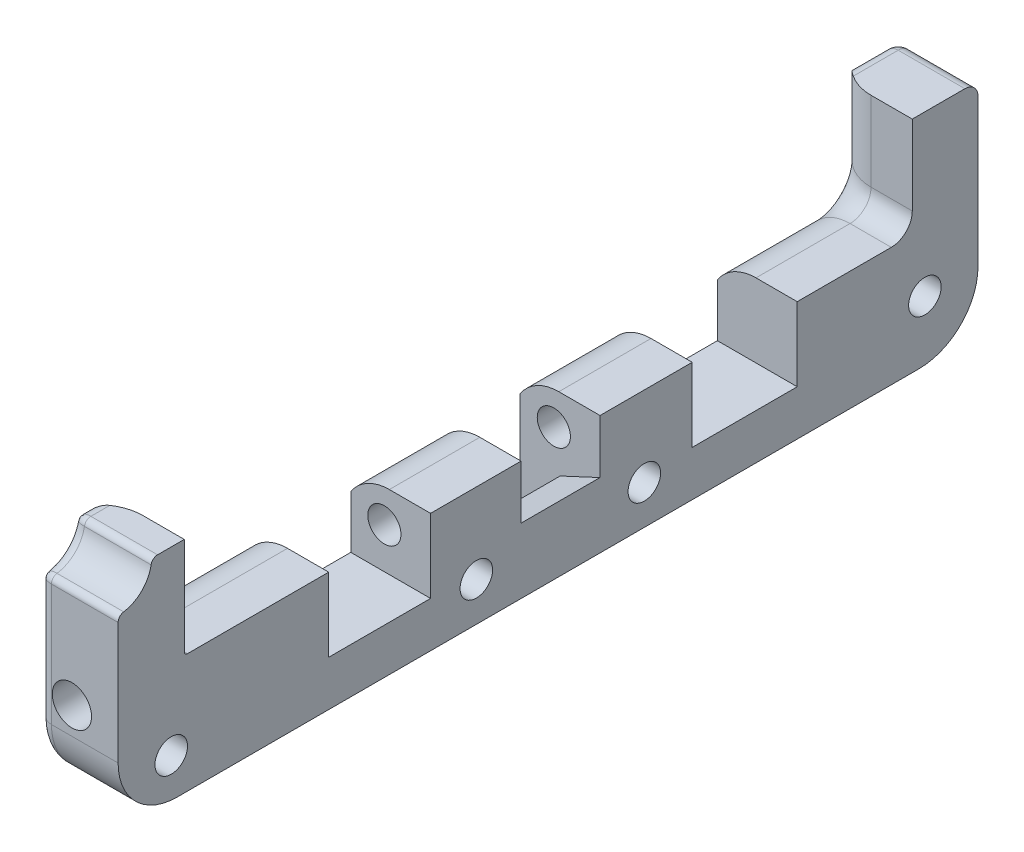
ISO-10303-21;
HEADER;
FILE_DESCRIPTION(('STEP AP214'),'2;1');
FILE_NAME('part.step','',(''),(''),'','','');
FILE_SCHEMA(('AUTOMOTIVE_DESIGN { 1 0 10303 214 1 1 1 1 }'));
ENDSEC;
DATA;
#1=APPLICATION_CONTEXT('core data for automotive mechanical design processes');
#2=APPLICATION_PROTOCOL_DEFINITION('international standard','automotive_design',2000,#1);
#3=PRODUCT_CONTEXT('',#1,'mechanical');
#4=PRODUCT('Part','Part','',(#3));
#5=PRODUCT_RELATED_PRODUCT_CATEGORY('part','',(#4));
#6=PRODUCT_DEFINITION_FORMATION('','',#4);
#7=PRODUCT_DEFINITION_CONTEXT('part definition',#1,'design');
#8=PRODUCT_DEFINITION('design','',#6,#7);
#9=PRODUCT_DEFINITION_SHAPE('','',#8);
#10=(LENGTH_UNIT() NAMED_UNIT(*) SI_UNIT(.MILLI.,.METRE.));
#11=(NAMED_UNIT(*) PLANE_ANGLE_UNIT() SI_UNIT($,.RADIAN.));
#12=(NAMED_UNIT(*) SI_UNIT($,.STERADIAN.) SOLID_ANGLE_UNIT());
#13=UNCERTAINTY_MEASURE_WITH_UNIT(LENGTH_MEASURE(1.E-05),#10,'distance_accuracy_value','');
#14=(GEOMETRIC_REPRESENTATION_CONTEXT(3) GLOBAL_UNCERTAINTY_ASSIGNED_CONTEXT((#13)) GLOBAL_UNIT_ASSIGNED_CONTEXT((#10,
#11,#12)) REPRESENTATION_CONTEXT('',''));
#15=CARTESIAN_POINT('',(0.,0.,0.));
#16=DIRECTION('',(0.,0.,1.));
#17=DIRECTION('',(1.,0.,0.));
#18=AXIS2_PLACEMENT_3D('',#15,#16,#17);
#19=CARTESIAN_POINT('',(0.,17.1358657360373,5.63245));
#20=DIRECTION('',(1.,0.,0.));
#21=DIRECTION('',(0.,0.,-1.));
#22=AXIS2_PLACEMENT_3D('',#19,#20,#21);
#23=PLANE('',#22);
#24=CARTESIAN_POINT('',(0.,0.,-57.2262));
#25=DIRECTION('',(1.,0.,0.));
#26=DIRECTION('',(0.,0.,-1.));
#27=AXIS2_PLACEMENT_3D('',#24,#25,#26);
#28=CIRCLE('',#27,2.8777112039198);
#29=CARTESIAN_POINT('',(0.,0.,-60.1039112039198));
#30=VERTEX_POINT('',#29);
#31=EDGE_CURVE('E426',#30,#30,#28,.T.);
#32=ORIENTED_EDGE('',*,*,#31,.T.);
#33=EDGE_LOOP('',(#32));
#34=FACE_BOUND('',#33,.T.);
#35=CARTESIAN_POINT('',(0.,2.54,-91.1606));
#36=DIRECTION('',(1.,0.,0.));
#37=DIRECTION('',(0.,0.,-1.));
#38=AXIS2_PLACEMENT_3D('',#35,#36,#37);
#39=CIRCLE('',#38,2.87771120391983);
#40=CARTESIAN_POINT('',(0.,2.54,-94.0383112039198));
#41=VERTEX_POINT('',#40);
#42=EDGE_CURVE('E423',#41,#41,#39,.T.);
#43=ORIENTED_EDGE('',*,*,#42,.T.);
#44=EDGE_LOOP('',(#43));
#45=FACE_BOUND('',#44,.T.);
#46=DIRECTION('',(0.,1.,0.));
#47=VECTOR('',#46,1.);
#48=CARTESIAN_POINT('',(0.,12.2174,-92.1766));
#49=LINE('',#48,#47);
#50=CARTESIAN_POINT('',(0.,12.2174,-92.1766));
#51=VERTEX_POINT('',#50);
#52=CARTESIAN_POINT('',(0.,20.2565,-92.1766));
#53=VERTEX_POINT('',#52);
#54=EDGE_CURVE('E996',#51,#53,#49,.T.);
#55=ORIENTED_EDGE('',*,*,#54,.T.);
#56=DIRECTION('',(0.,0.,1.));
#57=VECTOR('',#56,1.);
#58=CARTESIAN_POINT('',(0.,20.2565,5.63245));
#59=LINE('',#58,#57);
#60=CARTESIAN_POINT('',(0.,20.2565,-95.9993));
#61=VERTEX_POINT('',#60);
#62=EDGE_CURVE('E448',#53,#61,#59,.F.);
#63=ORIENTED_EDGE('',*,*,#62,.T.);
#64=DIRECTION('',(0.,1.,0.));
#65=VECTOR('',#64,1.);
#66=CARTESIAN_POINT('',(0.,17.1358657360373,-95.9993));
#67=LINE('',#66,#65);
#68=CARTESIAN_POINT('',(0.,2.41935000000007,-95.9993));
#69=VERTEX_POINT('',#68);
#70=EDGE_CURVE('E446',#61,#69,#67,.F.);
#71=ORIENTED_EDGE('',*,*,#70,.T.);
#72=CARTESIAN_POINT('',(0.,2.41935000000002,-90.44305));
#73=DIRECTION('',(1.,0.,0.));
#74=DIRECTION('',(0.,0.,-1.));
#75=AXIS2_PLACEMENT_3D('',#72,#73,#74);
#76=CIRCLE('',#75,5.55625);
#77=CARTESIAN_POINT('',(0.,-3.13689999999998,-90.44305));
#78=VERTEX_POINT('',#77);
#79=EDGE_CURVE('E444',#69,#78,#76,.F.);
#80=ORIENTED_EDGE('',*,*,#79,.T.);
#81=DIRECTION('',(0.,0.,-1.));
#82=VECTOR('',#81,1.);
#83=CARTESIAN_POINT('',(0.,-3.13689999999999,5.63245));
#84=LINE('',#83,#82);
#85=CARTESIAN_POINT('',(0.,-3.13689999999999,-51.8668));
#86=VERTEX_POINT('',#85);
#87=EDGE_CURVE('E441',#78,#86,#84,.F.);
#88=ORIENTED_EDGE('',*,*,#87,.T.);
#89=DIRECTION('',(0.,-1.,0.));
#90=VECTOR('',#89,1.);
#91=CARTESIAN_POINT('',(0.,3.175,-51.8668));
#92=LINE('',#91,#90);
#93=CARTESIAN_POINT('',(0.,7.13739999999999,-51.8668));
#94=VERTEX_POINT('',#93);
#95=EDGE_CURVE('E746',#94,#86,#92,.T.);
#96=ORIENTED_EDGE('',*,*,#95,.F.);
#97=DIRECTION('',(0.,0.,-1.));
#98=VECTOR('',#97,1.);
#99=CARTESIAN_POINT('',(0.,7.1374,-1.971675));
#100=LINE('',#99,#98);
#101=CARTESIAN_POINT('',(0.,7.13739999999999,-63.0174));
#102=VERTEX_POINT('',#101);
#103=EDGE_CURVE('E57',#94,#102,#100,.T.);
#104=ORIENTED_EDGE('',*,*,#103,.T.);
#105=DIRECTION('',(0.,1.,0.));
#106=VECTOR('',#105,1.);
#107=CARTESIAN_POINT('',(0.,9.6774,-63.0174));
#108=LINE('',#107,#106);
#109=CARTESIAN_POINT('',(0.,0.762000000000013,-63.0174));
#110=VERTEX_POINT('',#109);
#111=EDGE_CURVE('E861',#110,#102,#108,.T.);
#112=ORIENTED_EDGE('',*,*,#111,.F.);
#113=DIRECTION('',(0.,0.,1.));
#114=VECTOR('',#113,1.);
#115=CARTESIAN_POINT('',(0.,0.762000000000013,-63.0174));
#116=LINE('',#115,#114);
#117=CARTESIAN_POINT('',(0.,0.762000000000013,-75.7174));
#118=VERTEX_POINT('',#117);
#119=EDGE_CURVE('E859',#118,#110,#116,.T.);
#120=ORIENTED_EDGE('',*,*,#119,.F.);
#121=DIRECTION('',(0.,-1.,0.));
#122=VECTOR('',#121,1.);
#123=CARTESIAN_POINT('',(0.,0.762000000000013,-75.7174));
#124=LINE('',#123,#122);
#125=CARTESIAN_POINT('',(0.,7.13739999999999,-75.7174));
#126=VERTEX_POINT('',#125);
#127=EDGE_CURVE('E797',#126,#118,#124,.T.);
#128=ORIENTED_EDGE('',*,*,#127,.F.);
#129=CARTESIAN_POINT('',(0.,7.13739999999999,-87.0966));
#130=VERTEX_POINT('',#129);
#131=EDGE_CURVE('E979',#126,#130,#100,.T.);
#132=ORIENTED_EDGE('',*,*,#131,.T.);
#133=CARTESIAN_POINT('',(0.,12.2174,-87.0966));
#134=DIRECTION('',(1.,0.,0.));
#135=DIRECTION('',(0.,0.,-1.));
#136=AXIS2_PLACEMENT_3D('',#133,#134,#135);
#137=CIRCLE('',#136,5.08000000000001);
#138=EDGE_CURVE('E988',#130,#51,#137,.T.);
#139=ORIENTED_EDGE('',*,*,#138,.T.);
#140=EDGE_LOOP('',(#55,#63,#71,#80,#88,#96,#104,#112,#120,#128,#132,#139));
#141=FACE_BOUND('',#140,.T.);
#142=ADVANCED_FACE('F37',(#34,#45,#141),#23,.F.);
#143=CARTESIAN_POINT('',(0.,0.,0.));
#144=DIRECTION('',(1.,0.,0.));
#145=DIRECTION('',(0.,0.,-1.));
#146=AXIS2_PLACEMENT_3D('',#143,#144,#145);
#147=CIRCLE('',#146,2.87771120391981);
#148=CARTESIAN_POINT('',(0.,0.,-2.87771120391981));
#149=VERTEX_POINT('',#148);
#150=EDGE_CURVE('E414',#149,#149,#147,.T.);
#151=ORIENTED_EDGE('',*,*,#150,.T.);
#152=EDGE_LOOP('',(#151));
#153=FACE_BOUND('',#152,.T.);
#154=CARTESIAN_POINT('',(0.,0.,-36.9062));
#155=DIRECTION('',(1.,0.,0.));
#156=DIRECTION('',(0.,0.,-1.));
#157=AXIS2_PLACEMENT_3D('',#154,#155,#156);
#158=CIRCLE('',#157,2.87771120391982);
#159=CARTESIAN_POINT('',(0.,0.,-39.7839112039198));
#160=VERTEX_POINT('',#159);
#161=EDGE_CURVE('E411',#160,#160,#158,.T.);
#162=ORIENTED_EDGE('',*,*,#161,.T.);
#163=EDGE_LOOP('',(#162));
#164=FACE_BOUND('',#163,.T.);
#165=CARTESIAN_POINT('',(0.,7.13739999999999,-31.369));
#166=VERTEX_POINT('',#165);
#167=CARTESIAN_POINT('',(0.,7.13739999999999,-42.3164));
#168=VERTEX_POINT('',#167);
#169=EDGE_CURVE('E65',#166,#168,#100,.T.);
#170=ORIENTED_EDGE('',*,*,#169,.T.);
#171=DIRECTION('',(0.,1.,0.));
#172=VECTOR('',#171,1.);
#173=CARTESIAN_POINT('',(0.,9.6774,-42.3164));
#174=LINE('',#173,#172);
#175=CARTESIAN_POINT('',(0.,-3.13689999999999,-42.3164));
#176=VERTEX_POINT('',#175);
#177=EDGE_CURVE('E865',#176,#168,#174,.T.);
#178=ORIENTED_EDGE('',*,*,#177,.F.);
#179=DIRECTION('',(0.,0.,-1.));
#180=VECTOR('',#179,1.);
#181=CARTESIAN_POINT('',(0.,-3.13689999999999,5.63245));
#182=LINE('',#181,#180);
#183=CARTESIAN_POINT('',(0.,-3.1369,-0.717550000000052));
#184=VERTEX_POINT('',#183);
#185=EDGE_CURVE('E474',#176,#184,#182,.F.);
#186=ORIENTED_EDGE('',*,*,#185,.T.);
#187=CARTESIAN_POINT('',(0.,2.41935,-0.71755));
#188=DIRECTION('',(1.,0.,0.));
#189=DIRECTION('',(0.,0.,-1.));
#190=AXIS2_PLACEMENT_3D('',#187,#188,#189);
#191=CIRCLE('',#190,5.55625);
#192=CARTESIAN_POINT('',(0.,2.41935000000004,4.8387));
#193=VERTEX_POINT('',#192);
#194=EDGE_CURVE('E472',#184,#193,#191,.F.);
#195=ORIENTED_EDGE('',*,*,#194,.T.);
#196=DIRECTION('',(0.,-1.,0.));
#197=VECTOR('',#196,1.);
#198=CARTESIAN_POINT('',(0.,17.1358657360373,4.8387));
#199=LINE('',#198,#197);
#200=CARTESIAN_POINT('',(0.,16.4972358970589,4.8387));
#201=VERTEX_POINT('',#200);
#202=EDGE_CURVE('E465',#193,#201,#199,.F.);
#203=ORIENTED_EDGE('',*,*,#202,.T.);
#204=CARTESIAN_POINT('',(0.,21.844,6.35));
#205=DIRECTION('',(1.,0.,0.));
#206=DIRECTION('',(0.,0.,-1.));
#207=AXIS2_PLACEMENT_3D('',#204,#205,#206);
#208=CIRCLE('',#207,5.55625);
#209=CARTESIAN_POINT('',(0.,20.2565,1.02536312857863));
#210=VERTEX_POINT('',#209);
#211=EDGE_CURVE('E467',#201,#210,#208,.T.);
#212=ORIENTED_EDGE('',*,*,#211,.T.);
#213=DIRECTION('',(0.,0.,1.));
#214=VECTOR('',#213,1.);
#215=CARTESIAN_POINT('',(0.,20.2565,5.63245));
#216=LINE('',#215,#214);
#217=CARTESIAN_POINT('',(0.,20.2565,0.965200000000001));
#218=VERTEX_POINT('',#217);
#219=EDGE_CURVE('E469',#210,#218,#216,.F.);
#220=ORIENTED_EDGE('',*,*,#219,.T.);
#221=DIRECTION('',(0.,1.,0.));
#222=VECTOR('',#221,1.);
#223=CARTESIAN_POINT('',(0.,10.074275,0.965200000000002));
#224=LINE('',#223,#222);
#225=CARTESIAN_POINT('',(0.,10.074275,0.965200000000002));
#226=VERTEX_POINT('',#225);
#227=EDGE_CURVE('E319',#226,#218,#224,.T.);
#228=ORIENTED_EDGE('',*,*,#227,.F.);
#229=CARTESIAN_POINT('',(0.,10.074275,-1.971675));
#230=DIRECTION('',(1.,0.,0.));
#231=DIRECTION('',(0.,0.,-1.));
#232=AXIS2_PLACEMENT_3D('',#229,#230,#231);
#233=CIRCLE('',#232,2.936875);
#234=CARTESIAN_POINT('',(0.,7.1374,-1.971675));
#235=VERTEX_POINT('',#234);
#236=EDGE_CURVE('E329',#226,#235,#233,.T.);
#237=ORIENTED_EDGE('',*,*,#236,.T.);
#238=CARTESIAN_POINT('',(0.,7.1374,-19.05));
#239=VERTEX_POINT('',#238);
#240=EDGE_CURVE('E975',#235,#239,#100,.T.);
#241=ORIENTED_EDGE('',*,*,#240,.T.);
#242=DIRECTION('',(0.,1.,0.));
#243=VECTOR('',#242,1.);
#244=CARTESIAN_POINT('',(0.,9.6774,-19.05));
#245=LINE('',#244,#243);
#246=CARTESIAN_POINT('',(0.,0.762000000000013,-19.05));
#247=VERTEX_POINT('',#246);
#248=EDGE_CURVE('E802',#247,#239,#245,.T.);
#249=ORIENTED_EDGE('',*,*,#248,.F.);
#250=DIRECTION('',(0.,0.,1.));
#251=VECTOR('',#250,1.);
#252=CARTESIAN_POINT('',(0.,0.762000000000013,-19.05));
#253=LINE('',#252,#251);
#254=CARTESIAN_POINT('',(0.,0.762000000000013,-31.369));
#255=VERTEX_POINT('',#254);
#256=EDGE_CURVE('E870',#255,#247,#253,.T.);
#257=ORIENTED_EDGE('',*,*,#256,.F.);
#258=DIRECTION('',(0.,-1.,0.));
#259=VECTOR('',#258,1.);
#260=CARTESIAN_POINT('',(0.,0.762000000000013,-31.369));
#261=LINE('',#260,#259);
#262=EDGE_CURVE('E868',#166,#255,#261,.T.);
#263=ORIENTED_EDGE('',*,*,#262,.F.);
#264=EDGE_LOOP('',(#170,#178,#186,#195,#203,#212,#220,#228,#237,#241,#249,#257,#263));
#265=FACE_BOUND('',#264,.T.);
#266=ADVANCED_FACE('F599',(#153,#164,#265),#23,.F.);
#267=CARTESIAN_POINT('',(9.652,21.844,-89.6366));
#268=DIRECTION('',(0.,-1.,0.));
#269=DIRECTION('',(0.,0.,-1.));
#270=AXIS2_PLACEMENT_3D('',#267,#268,#269);
#271=PLANE('',#270);
#272=CARTESIAN_POINT('',(4.66627796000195,21.844,-95.19285));
#273=DIRECTION('',(0.,1.,0.));
#274=DIRECTION('',(0.,0.,1.));
#275=AXIS2_PLACEMENT_3D('',#272,#273,#274);
#276=CIRCLE('',#275,5.55625);
#277=CARTESIAN_POINT('',(1.5875,21.844,-90.5675888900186));
#278=VERTEX_POINT('',#277);
#279=CARTESIAN_POINT('',(4.66627796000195,21.844,-89.6366));
#280=VERTEX_POINT('',#279);
#281=EDGE_CURVE('E991',#278,#280,#276,.T.);
#282=ORIENTED_EDGE('',*,*,#281,.T.);
#283=DIRECTION('',(-1.,0.,0.));
#284=VECTOR('',#283,1.);
#285=CARTESIAN_POINT('',(9.652,21.844,-89.6366));
#286=LINE('',#285,#284);
#287=CARTESIAN_POINT('',(9.652,21.844,-89.6366));
#288=VERTEX_POINT('',#287);
#289=EDGE_CURVE('E387',#288,#280,#286,.T.);
#290=ORIENTED_EDGE('',*,*,#289,.F.);
#291=DIRECTION('',(0.,0.,1.));
#292=VECTOR('',#291,1.);
#293=CARTESIAN_POINT('',(9.652,21.844,-89.6366));
#294=LINE('',#293,#292);
#295=CARTESIAN_POINT('',(9.652,21.844,-95.9993));
#296=VERTEX_POINT('',#295);
#297=EDGE_CURVE('E814',#296,#288,#294,.T.);
#298=ORIENTED_EDGE('',*,*,#297,.F.);
#299=DIRECTION('',(-1.,0.,0.));
#300=VECTOR('',#299,1.);
#301=CARTESIAN_POINT('',(9.652,21.844,-95.9993));
#302=LINE('',#301,#300);
#303=CARTESIAN_POINT('',(1.5875,21.844,-95.9993));
#304=VERTEX_POINT('',#303);
#305=EDGE_CURVE('E390',#296,#304,#302,.T.);
#306=ORIENTED_EDGE('',*,*,#305,.T.);
#307=DIRECTION('',(0.,0.,1.));
#308=VECTOR('',#307,1.);
#309=CARTESIAN_POINT('',(1.5875,21.844,-89.6366));
#310=LINE('',#309,#308);
#311=EDGE_CURVE('E438',#304,#278,#310,.T.);
#312=ORIENTED_EDGE('',*,*,#311,.T.);
#313=EDGE_LOOP('',(#282,#290,#298,#306,#312));
#314=FACE_BOUND('',#313,.T.);
#315=ADVANCED_FACE('F672',(#314),#271,.F.);
#316=CARTESIAN_POINT('',(9.652,12.2174,-89.6366));
#317=DIRECTION('',(0.,0.,-1.));
#318=DIRECTION('',(-1.,0.,0.));
#319=AXIS2_PLACEMENT_3D('',#316,#317,#318);
#320=PLANE('',#319);
#321=DIRECTION('',(0.,1.,0.));
#322=VECTOR('',#321,1.);
#323=CARTESIAN_POINT('',(4.66627796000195,12.2174,-89.6366));
#324=LINE('',#323,#322);
#325=CARTESIAN_POINT('',(4.66627796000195,12.2174,-89.6366));
#326=VERTEX_POINT('',#325);
#327=EDGE_CURVE('E994',#326,#280,#324,.T.);
#328=ORIENTED_EDGE('',*,*,#327,.F.);
#329=DIRECTION('',(-1.,0.,0.));
#330=VECTOR('',#329,1.);
#331=CARTESIAN_POINT('',(9.652,12.2174,-89.6366));
#332=LINE('',#331,#330);
#333=CARTESIAN_POINT('',(9.652,12.2174,-89.6366));
#334=VERTEX_POINT('',#333);
#335=EDGE_CURVE('E384',#334,#326,#332,.T.);
#336=ORIENTED_EDGE('',*,*,#335,.F.);
#337=DIRECTION('',(0.,-1.,0.));
#338=VECTOR('',#337,1.);
#339=CARTESIAN_POINT('',(9.652,12.2174,-89.6366));
#340=LINE('',#339,#338);
#341=EDGE_CURVE('E816',#288,#334,#340,.T.);
#342=ORIENTED_EDGE('',*,*,#341,.F.);
#343=ORIENTED_EDGE('',*,*,#289,.T.);
#344=EDGE_LOOP('',(#328,#336,#342,#343));
#345=FACE_BOUND('',#344,.T.);
#346=ADVANCED_FACE('F664',(#345),#320,.F.);
#347=CARTESIAN_POINT('',(9.652,9.6774,-75.7174));
#348=DIRECTION('',(0.,-1.,0.));
#349=DIRECTION('',(0.,0.,-1.));
#350=AXIS2_PLACEMENT_3D('',#347,#348,#349);
#351=PLANE('',#350);
#352=DIRECTION('',(0.,0.,-1.));
#353=VECTOR('',#352,1.);
#354=CARTESIAN_POINT('',(4.66627796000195,9.6774,-1.971675));
#355=LINE('',#354,#353);
#356=CARTESIAN_POINT('',(4.66627796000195,9.67739999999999,-75.7174));
#357=VERTEX_POINT('',#356);
#358=CARTESIAN_POINT('',(4.66627796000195,9.67739999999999,-87.0966));
#359=VERTEX_POINT('',#358);
#360=EDGE_CURVE('E1045',#357,#359,#355,.T.);
#361=ORIENTED_EDGE('',*,*,#360,.F.);
#362=DIRECTION('',(-1.,0.,0.));
#363=VECTOR('',#362,1.);
#364=CARTESIAN_POINT('',(9.652,9.6774,-75.7174));
#365=LINE('',#364,#363);
#366=CARTESIAN_POINT('',(9.652,9.6774,-75.7174));
#367=VERTEX_POINT('',#366);
#368=EDGE_CURVE('E378',#367,#357,#365,.T.);
#369=ORIENTED_EDGE('',*,*,#368,.F.);
#370=DIRECTION('',(0.,0.,1.));
#371=VECTOR('',#370,1.);
#372=CARTESIAN_POINT('',(9.652,9.6774,-75.7174));
#373=LINE('',#372,#371);
#374=CARTESIAN_POINT('',(9.652,9.6774,-87.0966));
#375=VERTEX_POINT('',#374);
#376=EDGE_CURVE('E820',#375,#367,#373,.T.);
#377=ORIENTED_EDGE('',*,*,#376,.F.);
#378=DIRECTION('',(-1.,0.,0.));
#379=VECTOR('',#378,1.);
#380=CARTESIAN_POINT('',(9.652,9.6774,-87.0966));
#381=LINE('',#380,#379);
#382=EDGE_CURVE('E381',#375,#359,#381,.T.);
#383=ORIENTED_EDGE('',*,*,#382,.T.);
#384=EDGE_LOOP('',(#361,#369,#377,#383));
#385=FACE_BOUND('',#384,.T.);
#386=ADVANCED_FACE('F660',(#385),#351,.F.);
#387=CARTESIAN_POINT('',(9.652,0.762000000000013,-75.7174));
#388=DIRECTION('',(0.,0.,-1.));
#389=DIRECTION('',(-1.,0.,0.));
#390=AXIS2_PLACEMENT_3D('',#387,#388,#389);
#391=PLANE('',#390);
#392=CARTESIAN_POINT('',(4.66627796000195,4.12114999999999,-75.7174));
#393=DIRECTION('',(0.,0.,-1.));
#394=DIRECTION('',(-1.,0.,0.));
#395=AXIS2_PLACEMENT_3D('',#392,#393,#394);
#396=CIRCLE('',#395,5.55625);
#397=EDGE_CURVE('E508',#126,#357,#396,.T.);
#398=ORIENTED_EDGE('',*,*,#397,.F.);
#399=ORIENTED_EDGE('',*,*,#127,.T.);
#400=DIRECTION('',(-1.,0.,0.));
#401=VECTOR('',#400,1.);
#402=CARTESIAN_POINT('',(9.652,0.762000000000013,-75.7174));
#403=LINE('',#402,#401);
#404=CARTESIAN_POINT('',(9.652,0.762000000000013,-75.7174));
#405=VERTEX_POINT('',#404);
#406=EDGE_CURVE('E375',#405,#118,#403,.T.);
#407=ORIENTED_EDGE('',*,*,#406,.F.);
#408=DIRECTION('',(0.,-1.,0.));
#409=VECTOR('',#408,1.);
#410=CARTESIAN_POINT('',(9.652,0.762000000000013,-75.7174));
#411=LINE('',#410,#409);
#412=EDGE_CURVE('E822',#367,#405,#411,.T.);
#413=ORIENTED_EDGE('',*,*,#412,.F.);
#414=ORIENTED_EDGE('',*,*,#368,.T.);
#415=EDGE_LOOP('',(#398,#399,#407,#413,#414));
#416=FACE_BOUND('',#415,.T.);
#417=ADVANCED_FACE('F652',(#416),#391,.F.);
#418=CARTESIAN_POINT('',(9.652,9.6774,-63.0174));
#419=DIRECTION('',(0.,0.,1.));
#420=DIRECTION('',(1.,0.,0.));
#421=AXIS2_PLACEMENT_3D('',#418,#419,#420);
#422=PLANE('',#421);
#423=CARTESIAN_POINT('',(4.064,5.6769,-63.0174));
#424=DIRECTION('',(0.,0.,1.));
#425=DIRECTION('',(1.,0.,0.));
#426=AXIS2_PLACEMENT_3D('',#423,#424,#425);
#427=CIRCLE('',#426,2.0066);
#428=CARTESIAN_POINT('',(6.0706,5.6769,-63.0174));
#429=VERTEX_POINT('',#428);
#430=EDGE_CURVE('E770',#429,#429,#427,.F.);
#431=ORIENTED_EDGE('',*,*,#430,.F.);
#432=EDGE_LOOP('',(#431));
#433=FACE_BOUND('',#432,.T.);
#434=CARTESIAN_POINT('',(4.66627796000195,4.12114999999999,-63.0174));
#435=DIRECTION('',(0.,0.,1.));
#436=DIRECTION('',(1.,0.,0.));
#437=AXIS2_PLACEMENT_3D('',#434,#435,#436);
#438=CIRCLE('',#437,5.55625);
#439=CARTESIAN_POINT('',(4.66627796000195,9.67739999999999,-63.0174));
#440=VERTEX_POINT('',#439);
#441=EDGE_CURVE('E1007',#440,#102,#438,.T.);
#442=ORIENTED_EDGE('',*,*,#441,.F.);
#443=DIRECTION('',(-1.,0.,0.));
#444=VECTOR('',#443,1.);
#445=CARTESIAN_POINT('',(9.652,9.6774,-63.0174));
#446=LINE('',#445,#444);
#447=CARTESIAN_POINT('',(9.652,9.6774,-63.0174));
#448=VERTEX_POINT('',#447);
#449=EDGE_CURVE('E369',#448,#440,#446,.T.);
#450=ORIENTED_EDGE('',*,*,#449,.F.);
#451=DIRECTION('',(0.,1.,0.));
#452=VECTOR('',#451,1.);
#453=CARTESIAN_POINT('',(9.652,9.6774,-63.0174));
#454=LINE('',#453,#452);
#455=CARTESIAN_POINT('',(9.652,0.762000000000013,-63.0174));
#456=VERTEX_POINT('',#455);
#457=EDGE_CURVE('E826',#456,#448,#454,.T.);
#458=ORIENTED_EDGE('',*,*,#457,.F.);
#459=DIRECTION('',(-1.,0.,0.));
#460=VECTOR('',#459,1.);
#461=CARTESIAN_POINT('',(9.652,0.762000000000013,-63.0174));
#462=LINE('',#461,#460);
#463=EDGE_CURVE('E372',#456,#110,#462,.T.);
#464=ORIENTED_EDGE('',*,*,#463,.T.);
#465=ORIENTED_EDGE('',*,*,#111,.T.);
#466=EDGE_LOOP('',(#442,#450,#458,#464,#465));
#467=FACE_BOUND('',#466,.T.);
#468=ADVANCED_FACE('F648',(#433,#467),#422,.F.);
#469=CARTESIAN_POINT('',(9.652,9.6774,-51.8668));
#470=DIRECTION('',(0.,-1.,0.));
#471=DIRECTION('',(0.,0.,-1.));
#472=AXIS2_PLACEMENT_3D('',#469,#470,#471);
#473=PLANE('',#472);
#474=CARTESIAN_POINT('',(4.66627796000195,9.67739999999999,-51.8668));
#475=VERTEX_POINT('',#474);
#476=EDGE_CURVE('E1020',#475,#440,#355,.T.);
#477=ORIENTED_EDGE('',*,*,#476,.F.);
#478=DIRECTION('',(-1.,0.,0.));
#479=VECTOR('',#478,1.);
#480=CARTESIAN_POINT('',(9.652,9.6774,-51.8668));
#481=LINE('',#480,#479);
#482=CARTESIAN_POINT('',(9.652,9.6774,-51.8668));
#483=VERTEX_POINT('',#482);
#484=EDGE_CURVE('E366',#483,#475,#481,.T.);
#485=ORIENTED_EDGE('',*,*,#484,.F.);
#486=DIRECTION('',(0.,0.,1.));
#487=VECTOR('',#486,1.);
#488=CARTESIAN_POINT('',(9.652,9.6774,-51.8668));
#489=LINE('',#488,#487);
#490=EDGE_CURVE('E828',#448,#483,#489,.T.);
#491=ORIENTED_EDGE('',*,*,#490,.F.);
#492=ORIENTED_EDGE('',*,*,#449,.T.);
#493=EDGE_LOOP('',(#477,#485,#491,#492));
#494=FACE_BOUND('',#493,.T.);
#495=ADVANCED_FACE('F644',(#494),#473,.F.);
#496=CARTESIAN_POINT('',(9.652,3.175,-51.8668));
#497=DIRECTION('',(0.,0.,-1.));
#498=DIRECTION('',(-1.,0.,0.));
#499=AXIS2_PLACEMENT_3D('',#496,#497,#498);
#500=PLANE('',#499);
#501=CARTESIAN_POINT('',(4.064,5.6769,-51.8668));
#502=DIRECTION('',(0.,0.,-1.));
#503=DIRECTION('',(-1.,0.,0.));
#504=AXIS2_PLACEMENT_3D('',#501,#502,#503);
#505=CIRCLE('',#504,2.0066);
#506=CARTESIAN_POINT('',(2.0574,5.6769,-51.8668));
#507=VERTEX_POINT('',#506);
#508=EDGE_CURVE('E776',#507,#507,#505,.T.);
#509=ORIENTED_EDGE('',*,*,#508,.T.);
#510=EDGE_LOOP('',(#509));
#511=FACE_BOUND('',#510,.T.);
#512=CARTESIAN_POINT('',(4.66627796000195,4.12114999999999,-51.8668));
#513=DIRECTION('',(0.,0.,-1.));
#514=DIRECTION('',(-1.,0.,0.));
#515=AXIS2_PLACEMENT_3D('',#512,#513,#514);
#516=CIRCLE('',#515,5.55625);
#517=EDGE_CURVE('E1005',#94,#475,#516,.T.);
#518=ORIENTED_EDGE('',*,*,#517,.F.);
#519=ORIENTED_EDGE('',*,*,#95,.T.);
#520=CARTESIAN_POINT('',(1.5875,-3.13689999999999,-51.8668));
#521=DIRECTION('',(0.,0.,-1.));
#522=DIRECTION('',(-1.,0.,0.));
#523=AXIS2_PLACEMENT_3D('',#520,#521,#522);
#524=CIRCLE('',#523,1.5875);
#525=CARTESIAN_POINT('',(1.5875,-4.7244,-51.8668));
#526=VERTEX_POINT('',#525);
#527=EDGE_CURVE('E482',#86,#526,#524,.F.);
#528=ORIENTED_EDGE('',*,*,#527,.T.);
#529=DIRECTION('',(1.,0.,0.));
#530=VECTOR('',#529,1.);
#531=CARTESIAN_POINT('',(4.826,-4.7244,-51.8668));
#532=LINE('',#531,#530);
#533=CARTESIAN_POINT('',(4.826,-4.7244,-51.8668));
#534=VERTEX_POINT('',#533);
#535=EDGE_CURVE('E498',#526,#534,#532,.T.);
#536=ORIENTED_EDGE('',*,*,#535,.T.);
#537=DIRECTION('',(0.,1.,0.));
#538=VECTOR('',#537,1.);
#539=CARTESIAN_POINT('',(4.826,0.924599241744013,-51.8668));
#540=LINE('',#539,#538);
#541=CARTESIAN_POINT('',(4.826,0.924599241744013,-51.8668));
#542=VERTEX_POINT('',#541);
#543=EDGE_CURVE('E752',#534,#542,#540,.T.);
#544=ORIENTED_EDGE('',*,*,#543,.T.);
#545=DIRECTION('',(0.906307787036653,0.422618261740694,0.));
#546=VECTOR('',#545,1.);
#547=CARTESIAN_POINT('',(9.652,3.175,-51.8668));
#548=LINE('',#547,#546);
#549=CARTESIAN_POINT('',(9.652,3.175,-51.8668));
#550=VERTEX_POINT('',#549);
#551=EDGE_CURVE('E764',#542,#550,#548,.T.);
#552=ORIENTED_EDGE('',*,*,#551,.T.);
#553=DIRECTION('',(0.,-1.,0.));
#554=VECTOR('',#553,1.);
#555=CARTESIAN_POINT('',(9.652,3.175,-51.8668));
#556=LINE('',#555,#554);
#557=EDGE_CURVE('E830',#483,#550,#556,.T.);
#558=ORIENTED_EDGE('',*,*,#557,.F.);
#559=ORIENTED_EDGE('',*,*,#484,.T.);
#560=EDGE_LOOP('',(#518,#519,#528,#536,#544,#552,#558,#559));
#561=FACE_BOUND('',#560,.T.);
#562=ADVANCED_FACE('F640',(#511,#561),#500,.F.);
#563=CARTESIAN_POINT('',(9.652,9.6774,-42.3164));
#564=DIRECTION('',(0.,0.,1.));
#565=DIRECTION('',(1.,0.,0.));
#566=AXIS2_PLACEMENT_3D('',#563,#564,#565);
#567=PLANE('',#566);
#568=CARTESIAN_POINT('',(4.064,5.6769,-42.3164));
#569=DIRECTION('',(0.,0.,1.));
#570=DIRECTION('',(1.,0.,0.));
#571=AXIS2_PLACEMENT_3D('',#568,#569,#570);
#572=CIRCLE('',#571,2.0066);
#573=CARTESIAN_POINT('',(6.0706,5.6769,-42.3164));
#574=VERTEX_POINT('',#573);
#575=EDGE_CURVE('E773',#574,#574,#572,.T.);
#576=ORIENTED_EDGE('',*,*,#575,.T.);
#577=EDGE_LOOP('',(#576));
#578=FACE_BOUND('',#577,.T.);
#579=CARTESIAN_POINT('',(4.66627796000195,4.12114999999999,-42.3164));
#580=DIRECTION('',(0.,0.,1.));
#581=DIRECTION('',(1.,0.,0.));
#582=AXIS2_PLACEMENT_3D('',#579,#580,#581);
#583=CIRCLE('',#582,5.55625);
#584=CARTESIAN_POINT('',(4.66627796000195,9.67739999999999,-42.3164));
#585=VERTEX_POINT('',#584);
#586=EDGE_CURVE('E1003',#585,#168,#583,.T.);
#587=ORIENTED_EDGE('',*,*,#586,.F.);
#588=DIRECTION('',(-1.,0.,0.));
#589=VECTOR('',#588,1.);
#590=CARTESIAN_POINT('',(9.652,9.6774,-42.3164));
#591=LINE('',#590,#589);
#592=CARTESIAN_POINT('',(9.652,9.6774,-42.3164));
#593=VERTEX_POINT('',#592);
#594=EDGE_CURVE('E363',#593,#585,#591,.T.);
#595=ORIENTED_EDGE('',*,*,#594,.F.);
#596=DIRECTION('',(0.,1.,0.));
#597=VECTOR('',#596,1.);
#598=CARTESIAN_POINT('',(9.652,9.6774,-42.3164));
#599=LINE('',#598,#597);
#600=CARTESIAN_POINT('',(9.652,3.175,-42.3164));
#601=VERTEX_POINT('',#600);
#602=EDGE_CURVE('E836',#601,#593,#599,.T.);
#603=ORIENTED_EDGE('',*,*,#602,.F.);
#604=DIRECTION('',(0.906307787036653,0.422618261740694,0.));
#605=VECTOR('',#604,1.);
#606=CARTESIAN_POINT('',(9.652,3.175,-42.3164));
#607=LINE('',#606,#605);
#608=CARTESIAN_POINT('',(4.826,0.924599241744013,-42.3164));
#609=VERTEX_POINT('',#608);
#610=EDGE_CURVE('E763',#609,#601,#607,.T.);
#611=ORIENTED_EDGE('',*,*,#610,.F.);
#612=DIRECTION('',(0.,1.,0.));
#613=VECTOR('',#612,1.);
#614=CARTESIAN_POINT('',(4.826,0.924599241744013,-42.3164));
#615=LINE('',#614,#613);
#616=CARTESIAN_POINT('',(4.826,-4.7244,-42.3164));
#617=VERTEX_POINT('',#616);
#618=EDGE_CURVE('E757',#617,#609,#615,.T.);
#619=ORIENTED_EDGE('',*,*,#618,.F.);
#620=DIRECTION('',(1.,0.,0.));
#621=VECTOR('',#620,1.);
#622=CARTESIAN_POINT('',(4.826,-4.7244,-42.3164));
#623=LINE('',#622,#621);
#624=CARTESIAN_POINT('',(1.5875,-4.7244,-42.3164));
#625=VERTEX_POINT('',#624);
#626=EDGE_CURVE('E761',#625,#617,#623,.T.);
#627=ORIENTED_EDGE('',*,*,#626,.F.);
#628=CARTESIAN_POINT('',(1.5875,-3.13689999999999,-42.3164));
#629=DIRECTION('',(0.,0.,1.));
#630=DIRECTION('',(1.,0.,0.));
#631=AXIS2_PLACEMENT_3D('',#628,#629,#630);
#632=CIRCLE('',#631,1.5875);
#633=EDGE_CURVE('E463',#625,#176,#632,.F.);
#634=ORIENTED_EDGE('',*,*,#633,.T.);
#635=ORIENTED_EDGE('',*,*,#177,.T.);
#636=EDGE_LOOP('',(#587,#595,#603,#611,#619,#627,#634,#635));
#637=FACE_BOUND('',#636,.T.);
#638=ADVANCED_FACE('F636',(#578,#637),#567,.F.);
#639=CARTESIAN_POINT('',(9.652,9.6774,-31.369));
#640=DIRECTION('',(0.,-1.,0.));
#641=DIRECTION('',(0.,0.,-1.));
#642=AXIS2_PLACEMENT_3D('',#639,#640,#641);
#643=PLANE('',#642);
#644=CARTESIAN_POINT('',(4.66627796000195,9.67739999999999,-31.369));
#645=VERTEX_POINT('',#644);
#646=EDGE_CURVE('E1049',#645,#585,#355,.T.);
#647=ORIENTED_EDGE('',*,*,#646,.F.);
#648=DIRECTION('',(-1.,0.,0.));
#649=VECTOR('',#648,1.);
#650=CARTESIAN_POINT('',(9.652,9.6774,-31.369));
#651=LINE('',#650,#649);
#652=CARTESIAN_POINT('',(9.652,9.6774,-31.369));
#653=VERTEX_POINT('',#652);
#654=EDGE_CURVE('E360',#653,#645,#651,.T.);
#655=ORIENTED_EDGE('',*,*,#654,.F.);
#656=DIRECTION('',(0.,0.,1.));
#657=VECTOR('',#656,1.);
#658=CARTESIAN_POINT('',(9.652,9.6774,-31.369));
#659=LINE('',#658,#657);
#660=EDGE_CURVE('E838',#593,#653,#659,.T.);
#661=ORIENTED_EDGE('',*,*,#660,.F.);
#662=ORIENTED_EDGE('',*,*,#594,.T.);
#663=EDGE_LOOP('',(#647,#655,#661,#662));
#664=FACE_BOUND('',#663,.T.);
#665=ADVANCED_FACE('F632',(#664),#643,.F.);
#666=CARTESIAN_POINT('',(9.652,0.762000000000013,-31.369));
#667=DIRECTION('',(0.,0.,-1.));
#668=DIRECTION('',(-1.,0.,0.));
#669=AXIS2_PLACEMENT_3D('',#666,#667,#668);
#670=PLANE('',#669);
#671=CARTESIAN_POINT('',(4.064,5.6769,-31.369));
#672=DIRECTION('',(0.,0.,1.));
#673=DIRECTION('',(1.,0.,0.));
#674=AXIS2_PLACEMENT_3D('',#671,#672,#673);
#675=CIRCLE('',#674,2.0066);
#676=CARTESIAN_POINT('',(6.0706,5.6769,-31.369));
#677=VERTEX_POINT('',#676);
#678=EDGE_CURVE('E760',#677,#677,#675,.T.);
#679=ORIENTED_EDGE('',*,*,#678,.F.);
#680=EDGE_LOOP('',(#679));
#681=FACE_BOUND('',#680,.T.);
#682=CARTESIAN_POINT('',(4.66627796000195,4.12115,-31.369));
#683=DIRECTION('',(0.,0.,-1.));
#684=DIRECTION('',(-1.,0.,0.));
#685=AXIS2_PLACEMENT_3D('',#682,#683,#684);
#686=CIRCLE('',#685,5.55625);
#687=EDGE_CURVE('E1001',#166,#645,#686,.T.);
#688=ORIENTED_EDGE('',*,*,#687,.F.);
#689=ORIENTED_EDGE('',*,*,#262,.T.);
#690=DIRECTION('',(-1.,0.,0.));
#691=VECTOR('',#690,1.);
#692=CARTESIAN_POINT('',(9.652,0.762000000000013,-31.369));
#693=LINE('',#692,#691);
#694=CARTESIAN_POINT('',(9.652,0.762000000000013,-31.369));
#695=VERTEX_POINT('',#694);
#696=EDGE_CURVE('E357',#695,#255,#693,.T.);
#697=ORIENTED_EDGE('',*,*,#696,.F.);
#698=DIRECTION('',(0.,-1.,0.));
#699=VECTOR('',#698,1.);
#700=CARTESIAN_POINT('',(9.652,0.762000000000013,-31.369));
#701=LINE('',#700,#699);
#702=EDGE_CURVE('E840',#653,#695,#701,.T.);
#703=ORIENTED_EDGE('',*,*,#702,.F.);
#704=ORIENTED_EDGE('',*,*,#654,.T.);
#705=EDGE_LOOP('',(#688,#689,#697,#703,#704));
#706=FACE_BOUND('',#705,.T.);
#707=ADVANCED_FACE('F624',(#681,#706),#670,.F.);
#708=CARTESIAN_POINT('',(9.652,9.6774,-19.05));
#709=DIRECTION('',(0.,0.,1.));
#710=DIRECTION('',(1.,0.,0.));
#711=AXIS2_PLACEMENT_3D('',#708,#709,#710);
#712=PLANE('',#711);
#713=CARTESIAN_POINT('',(4.064,5.6769,-19.05));
#714=DIRECTION('',(0.,0.,1.));
#715=DIRECTION('',(1.,0.,0.));
#716=AXIS2_PLACEMENT_3D('',#713,#714,#715);
#717=CIRCLE('',#716,2.3749);
#718=CARTESIAN_POINT('',(6.4389,5.6769,-19.05));
#719=VERTEX_POINT('',#718);
#720=EDGE_CURVE('E782',#719,#719,#717,.F.);
#721=ORIENTED_EDGE('',*,*,#720,.F.);
#722=EDGE_LOOP('',(#721));
#723=FACE_BOUND('',#722,.T.);
#724=CARTESIAN_POINT('',(4.66627796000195,4.12115,-19.05));
#725=DIRECTION('',(0.,0.,1.));
#726=DIRECTION('',(1.,0.,0.));
#727=AXIS2_PLACEMENT_3D('',#724,#725,#726);
#728=CIRCLE('',#727,5.55625);
#729=CARTESIAN_POINT('',(4.66627796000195,9.67739999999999,-19.05));
#730=VERTEX_POINT('',#729);
#731=EDGE_CURVE('E999',#730,#239,#728,.T.);
#732=ORIENTED_EDGE('',*,*,#731,.F.);
#733=DIRECTION('',(-1.,0.,0.));
#734=VECTOR('',#733,1.);
#735=CARTESIAN_POINT('',(9.652,9.6774,-19.05));
#736=LINE('',#735,#734);
#737=CARTESIAN_POINT('',(9.652,9.6774,-19.05));
#738=VERTEX_POINT('',#737);
#739=EDGE_CURVE('E346',#738,#730,#736,.T.);
#740=ORIENTED_EDGE('',*,*,#739,.F.);
#741=DIRECTION('',(0.,1.,0.));
#742=VECTOR('',#741,1.);
#743=CARTESIAN_POINT('',(9.652,9.6774,-19.05));
#744=LINE('',#743,#742);
#745=CARTESIAN_POINT('',(9.652,0.762000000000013,-19.05));
#746=VERTEX_POINT('',#745);
#747=EDGE_CURVE('E844',#746,#738,#744,.T.);
#748=ORIENTED_EDGE('',*,*,#747,.F.);
#749=DIRECTION('',(-1.,0.,0.));
#750=VECTOR('',#749,1.);
#751=CARTESIAN_POINT('',(9.652,0.762000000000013,-19.05));
#752=LINE('',#751,#750);
#753=EDGE_CURVE('E354',#746,#247,#752,.T.);
#754=ORIENTED_EDGE('',*,*,#753,.T.);
#755=ORIENTED_EDGE('',*,*,#248,.T.);
#756=EDGE_LOOP('',(#732,#740,#748,#754,#755));
#757=FACE_BOUND('',#756,.T.);
#758=ADVANCED_FACE('F620',(#723,#757),#712,.F.);
#759=CARTESIAN_POINT('',(9.652,9.6774,-1.971675));
#760=DIRECTION('',(0.,-1.,0.));
#761=DIRECTION('',(0.,0.,-1.));
#762=AXIS2_PLACEMENT_3D('',#759,#760,#761);
#763=PLANE('',#762);
#764=CARTESIAN_POINT('',(4.66627796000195,9.6774,-1.971675));
#765=VERTEX_POINT('',#764);
#766=EDGE_CURVE('E982',#765,#730,#355,.T.);
#767=ORIENTED_EDGE('',*,*,#766,.F.);
#768=DIRECTION('',(-1.,0.,0.));
#769=VECTOR('',#768,1.);
#770=CARTESIAN_POINT('',(9.652,9.6774,-1.971675));
#771=LINE('',#770,#769);
#772=CARTESIAN_POINT('',(9.652,9.6774,-1.971675));
#773=VERTEX_POINT('',#772);
#774=EDGE_CURVE('E339',#773,#765,#771,.T.);
#775=ORIENTED_EDGE('',*,*,#774,.F.);
#776=DIRECTION('',(0.,0.,1.));
#777=VECTOR('',#776,1.);
#778=CARTESIAN_POINT('',(9.652,9.6774,-1.971675));
#779=LINE('',#778,#777);
#780=EDGE_CURVE('E846',#738,#773,#779,.T.);
#781=ORIENTED_EDGE('',*,*,#780,.F.);
#782=ORIENTED_EDGE('',*,*,#739,.T.);
#783=EDGE_LOOP('',(#767,#775,#781,#782));
#784=FACE_BOUND('',#783,.T.);
#785=ADVANCED_FACE('F614',(#784),#763,.F.);
#786=CARTESIAN_POINT('',(9.652,21.844,-1.5748));
#787=DIRECTION('',(0.,0.,1.));
#788=DIRECTION('',(0.,-1.,0.));
#789=AXIS2_PLACEMENT_3D('',#786,#787,#788);
#790=PLANE('',#789);
#791=DIRECTION('',(0.,1.,0.));
#792=VECTOR('',#791,1.);
#793=CARTESIAN_POINT('',(4.66627796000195,10.074275,-1.5748));
#794=LINE('',#793,#792);
#795=CARTESIAN_POINT('',(4.66627796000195,10.074275,-1.5748));
#796=VERTEX_POINT('',#795);
#797=CARTESIAN_POINT('',(4.66627796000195,21.844,-1.5748));
#798=VERTEX_POINT('',#797);
#799=EDGE_CURVE('E308',#796,#798,#794,.T.);
#800=ORIENTED_EDGE('',*,*,#799,.T.);
#801=DIRECTION('',(-1.,0.,0.));
#802=VECTOR('',#801,1.);
#803=CARTESIAN_POINT('',(9.652,21.844,-1.5748));
#804=LINE('',#803,#802);
#805=CARTESIAN_POINT('',(9.652,21.844,-1.5748));
#806=VERTEX_POINT('',#805);
#807=EDGE_CURVE('E344',#806,#798,#804,.T.);
#808=ORIENTED_EDGE('',*,*,#807,.F.);
#809=DIRECTION('',(0.,1.,0.));
#810=VECTOR('',#809,1.);
#811=CARTESIAN_POINT('',(9.652,21.844,-1.5748));
#812=LINE('',#811,#810);
#813=CARTESIAN_POINT('',(9.652,10.074275,-1.5748));
#814=VERTEX_POINT('',#813);
#815=EDGE_CURVE('E343',#814,#806,#812,.T.);
#816=ORIENTED_EDGE('',*,*,#815,.F.);
#817=DIRECTION('',(-1.,0.,0.));
#818=VECTOR('',#817,1.);
#819=CARTESIAN_POINT('',(9.652,10.074275,-1.5748));
#820=LINE('',#819,#818);
#821=EDGE_CURVE('E336',#814,#796,#820,.T.);
#822=ORIENTED_EDGE('',*,*,#821,.T.);
#823=EDGE_LOOP('',(#800,#808,#816,#822));
#824=FACE_BOUND('',#823,.T.);
#825=ADVANCED_FACE('F342',(#824),#790,.F.);
#826=CARTESIAN_POINT('',(1.5875,20.2565,-89.6366));
#827=DIRECTION('',(0.,0.,1.));
#828=DIRECTION('',(1.,0.,0.));
#829=AXIS2_PLACEMENT_3D('',#826,#827,#828);
#830=CYLINDRICAL_SURFACE('',#829,1.5875);
#831=ORIENTED_EDGE('',*,*,#62,.F.);
#832=CARTESIAN_POINT('',(0.,20.2565,-92.1766));
#833=CARTESIAN_POINT('',(-3.95266970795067E-06,20.283060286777,-92.1766086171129));
#834=CARTESIAN_POINT('',(0.000666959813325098,20.3096055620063,-92.1755679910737));
#835=CARTESIAN_POINT('',(0.00331912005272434,20.3624407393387,-92.1714698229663));
#836=CARTESIAN_POINT('',(0.00529868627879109,20.3887309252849,-92.1684148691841));
#837=CARTESIAN_POINT('',(0.013077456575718,20.4663195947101,-92.1564488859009));
#838=CARTESIAN_POINT('',(0.0207190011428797,20.5170214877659,-92.1447322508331));
#839=CARTESIAN_POINT('',(0.0431454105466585,20.6297553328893,-92.1107936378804));
#840=CARTESIAN_POINT('',(0.0593503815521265,20.6908666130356,-92.0865225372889));
#841=CARTESIAN_POINT('',(0.0975602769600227,20.807913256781,-92.0305898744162));
#842=CARTESIAN_POINT('',(0.119597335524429,20.8638175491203,-91.9988874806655));
#843=CARTESIAN_POINT('',(0.18280992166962,21.001980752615,-91.9103429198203));
#844=CARTESIAN_POINT('',(0.227576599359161,21.0801599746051,-91.8497563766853));
#845=CARTESIAN_POINT('',(0.326387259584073,21.2247090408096,-91.722429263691));
#846=CARTESIAN_POINT('',(0.38045203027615,21.2910517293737,-91.6556750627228));
#847=CARTESIAN_POINT('',(0.478971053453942,21.3943653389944,-91.5401427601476));
#848=CARTESIAN_POINT('',(0.521354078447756,21.434135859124,-91.4920655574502));
#849=CARTESIAN_POINT('',(0.609804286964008,21.5085423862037,-91.3953190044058));
#850=CARTESIAN_POINT('',(0.655872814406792,21.5431765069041,-91.3466494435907));
#851=CARTESIAN_POINT('',(0.799146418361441,21.6392032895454,-91.2008997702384));
#852=CARTESIAN_POINT('',(0.901652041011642,21.6929618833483,-91.103800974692));
#853=CARTESIAN_POINT('',(1.09912677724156,21.7700045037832,-90.9312467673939));
#854=CARTESIAN_POINT('',(1.19201564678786,21.7970745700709,-90.8550947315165));
#855=CARTESIAN_POINT('',(1.33661840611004,21.8248209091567,-90.7443687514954));
#856=CARTESIAN_POINT('',(1.38576235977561,21.8319273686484,-90.7080004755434));
#857=CARTESIAN_POINT('',(1.48556727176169,21.8415171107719,-90.6366702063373));
#858=CARTESIAN_POINT('',(1.5362296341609,21.843995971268,-90.6017095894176));
#859=CARTESIAN_POINT('',(1.58749999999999,21.844,-90.5675888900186));
#860=B_SPLINE_CURVE_WITH_KNOTS('',3,(#832,#833,#834,#835,#836,#837,#838,#839,#840,#841,#842,
#843,#844,#845,#846,#847,#848,#849,#850,#851,#852,#853,#854,#855,#856,#857,#858,#859),
.UNSPECIFIED.,.F.,.F.,(4,2,2,2,2,2,2,2,2,2,2,2,2,4),(0.,0.0796247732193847,0.159147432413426,
0.316167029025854,0.518217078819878,0.721404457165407,1.04533222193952,1.36999385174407,
1.59600895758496,1.82210685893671,2.27301212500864,2.64100265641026,2.82546001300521,
3.01009354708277),.UNSPECIFIED.);
#861=EDGE_CURVE('E11',#53,#278,#860,.T.);
#862=ORIENTED_EDGE('',*,*,#861,.T.);
#863=ORIENTED_EDGE('',*,*,#311,.F.);
#864=CARTESIAN_POINT('',(1.5875,20.2565,-95.9993));
#865=DIRECTION('',(0.,0.,-1.));
#866=DIRECTION('',(-1.,0.,0.));
#867=AXIS2_PLACEMENT_3D('',#864,#865,#866);
#868=CIRCLE('',#867,1.5875);
#869=EDGE_CURVE('E486',#61,#304,#868,.T.);
#870=ORIENTED_EDGE('',*,*,#869,.F.);
#871=EDGE_LOOP('',(#831,#862,#863,#870));
#872=FACE_BOUND('',#871,.T.);
#873=ADVANCED_FACE('F595',(#872),#830,.T.);
#874=CARTESIAN_POINT('',(9.652,17.1358657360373,5.63245));
#875=DIRECTION('',(1.,0.,0.));
#876=DIRECTION('',(0.,0.,-1.));
#877=AXIS2_PLACEMENT_3D('',#874,#875,#876);
#878=PLANE('',#877);
#879=CARTESIAN_POINT('',(9.652,0.,-57.2262));
#880=DIRECTION('',(1.,0.,0.));
#881=DIRECTION('',(0.,0.,-1.));
#882=AXIS2_PLACEMENT_3D('',#879,#880,#881);
#883=CIRCLE('',#882,1.9685);
#884=CARTESIAN_POINT('',(9.652,0.,-59.1947));
#885=VERTEX_POINT('',#884);
#886=EDGE_CURVE('E788',#885,#885,#883,.T.);
#887=ORIENTED_EDGE('',*,*,#886,.F.);
#888=EDGE_LOOP('',(#887));
#889=FACE_BOUND('',#888,.T.);
#890=CARTESIAN_POINT('',(9.652,0.,0.));
#891=DIRECTION('',(1.,0.,0.));
#892=DIRECTION('',(0.,0.,-1.));
#893=AXIS2_PLACEMENT_3D('',#890,#891,#892);
#894=CIRCLE('',#893,1.9685);
#895=CARTESIAN_POINT('',(9.652,0.,-1.9685));
#896=VERTEX_POINT('',#895);
#897=EDGE_CURVE('E794',#896,#896,#894,.T.);
#898=ORIENTED_EDGE('',*,*,#897,.F.);
#899=EDGE_LOOP('',(#898));
#900=FACE_BOUND('',#899,.T.);
#901=CARTESIAN_POINT('',(9.652,17.1358657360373,5.63245));
#902=DIRECTION('',(1.,0.,0.));
#903=DIRECTION('',(0.,0.,-1.));
#904=AXIS2_PLACEMENT_3D('',#901,#902,#903);
#905=CIRCLE('',#904,0.79375);
#906=CARTESIAN_POINT('',(9.652,17.920554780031,5.75204166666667));
#907=VERTEX_POINT('',#906);
#908=CARTESIAN_POINT('',(9.652,17.1358657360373,6.4262));
#909=VERTEX_POINT('',#908);
#910=EDGE_CURVE('E798',#907,#909,#905,.T.);
#911=ORIENTED_EDGE('',*,*,#910,.T.);
#912=DIRECTION('',(0.,-1.,0.));
#913=VECTOR('',#912,1.);
#914=CARTESIAN_POINT('',(9.652,2.41935000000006,6.4262));
#915=LINE('',#914,#913);
#916=CARTESIAN_POINT('',(9.652,2.41935000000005,6.4262));
#917=VERTEX_POINT('',#916);
#918=EDGE_CURVE('E801',#909,#917,#915,.T.);
#919=ORIENTED_EDGE('',*,*,#918,.T.);
#920=CARTESIAN_POINT('',(9.652,2.41935,-0.71755));
#921=DIRECTION('',(1.,0.,0.));
#922=DIRECTION('',(0.,0.,1.));
#923=AXIS2_PLACEMENT_3D('',#920,#921,#922);
#924=CIRCLE('',#923,7.14375);
#925=CARTESIAN_POINT('',(9.652,-4.7244,-0.717550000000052));
#926=VERTEX_POINT('',#925);
#927=EDGE_CURVE('E804',#917,#926,#924,.T.);
#928=ORIENTED_EDGE('',*,*,#927,.T.);
#929=DIRECTION('',(0.,0.,-1.));
#930=VECTOR('',#929,1.);
#931=CARTESIAN_POINT('',(9.652,-4.72439999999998,-90.44305));
#932=LINE('',#931,#930);
#933=CARTESIAN_POINT('',(9.652,-4.72439999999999,-90.44305));
#934=VERTEX_POINT('',#933);
#935=EDGE_CURVE('E806',#926,#934,#932,.T.);
#936=ORIENTED_EDGE('',*,*,#935,.T.);
#937=CARTESIAN_POINT('',(9.652,2.41935000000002,-90.44305));
#938=DIRECTION('',(1.,0.,0.));
#939=DIRECTION('',(0.,0.,1.));
#940=AXIS2_PLACEMENT_3D('',#937,#938,#939);
#941=CIRCLE('',#940,7.14375);
#942=CARTESIAN_POINT('',(9.652,2.41935000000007,-97.5868));
#943=VERTEX_POINT('',#942);
#944=EDGE_CURVE('E808',#934,#943,#941,.T.);
#945=ORIENTED_EDGE('',*,*,#944,.T.);
#946=DIRECTION('',(0.,1.,0.));
#947=VECTOR('',#946,1.);
#948=CARTESIAN_POINT('',(9.652,20.2565,-97.5868));
#949=LINE('',#948,#947);
#950=CARTESIAN_POINT('',(9.652,20.2565,-97.5868));
#951=VERTEX_POINT('',#950);
#952=EDGE_CURVE('E810',#943,#951,#949,.T.);
#953=ORIENTED_EDGE('',*,*,#952,.T.);
#954=CARTESIAN_POINT('',(9.652,20.2565,-95.9993));
#955=DIRECTION('',(1.,0.,0.));
#956=DIRECTION('',(0.,0.,1.));
#957=AXIS2_PLACEMENT_3D('',#954,#955,#956);
#958=CIRCLE('',#957,1.5875);
#959=EDGE_CURVE('E812',#951,#296,#958,.T.);
#960=ORIENTED_EDGE('',*,*,#959,.T.);
#961=ORIENTED_EDGE('',*,*,#297,.T.);
#962=ORIENTED_EDGE('',*,*,#341,.T.);
#963=CARTESIAN_POINT('',(9.652,12.2174,-87.0966));
#964=DIRECTION('',(-1.,0.,0.));
#965=DIRECTION('',(0.,0.,-1.));
#966=AXIS2_PLACEMENT_3D('',#963,#964,#965);
#967=CIRCLE('',#966,2.54);
#968=EDGE_CURVE('E818',#334,#375,#967,.T.);
#969=ORIENTED_EDGE('',*,*,#968,.T.);
#970=ORIENTED_EDGE('',*,*,#376,.T.);
#971=ORIENTED_EDGE('',*,*,#412,.T.);
#972=DIRECTION('',(0.,0.,1.));
#973=VECTOR('',#972,1.);
#974=CARTESIAN_POINT('',(9.652,0.762000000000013,-63.0174));
#975=LINE('',#974,#973);
#976=EDGE_CURVE('E824',#405,#456,#975,.T.);
#977=ORIENTED_EDGE('',*,*,#976,.T.);
#978=ORIENTED_EDGE('',*,*,#457,.T.);
#979=ORIENTED_EDGE('',*,*,#490,.T.);
#980=ORIENTED_EDGE('',*,*,#557,.T.);
#981=DIRECTION('',(0.,0.,1.));
#982=VECTOR('',#981,1.);
#983=CARTESIAN_POINT('',(9.652,3.175,-42.3164));
#984=LINE('',#983,#982);
#985=EDGE_CURVE('E833',#550,#601,#984,.T.);
#986=ORIENTED_EDGE('',*,*,#985,.T.);
#987=ORIENTED_EDGE('',*,*,#602,.T.);
#988=ORIENTED_EDGE('',*,*,#660,.T.);
#989=ORIENTED_EDGE('',*,*,#702,.T.);
#990=DIRECTION('',(0.,0.,1.));
#991=VECTOR('',#990,1.);
#992=CARTESIAN_POINT('',(9.652,0.762000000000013,-19.05));
#993=LINE('',#992,#991);
#994=EDGE_CURVE('E842',#695,#746,#993,.T.);
#995=ORIENTED_EDGE('',*,*,#994,.T.);
#996=ORIENTED_EDGE('',*,*,#747,.T.);
#997=ORIENTED_EDGE('',*,*,#780,.T.);
#998=CARTESIAN_POINT('',(9.652,10.074275,-1.971675));
#999=DIRECTION('',(-1.,0.,0.));
#1000=DIRECTION('',(0.,0.,-1.));
#1001=AXIS2_PLACEMENT_3D('',#998,#999,#1000);
#1002=CIRCLE('',#1001,0.396875);
#1003=EDGE_CURVE('E848',#773,#814,#1002,.T.);
#1004=ORIENTED_EDGE('',*,*,#1003,.T.);
#1005=ORIENTED_EDGE('',*,*,#815,.T.);
#1006=DIRECTION('',(0.,0.,1.));
#1007=VECTOR('',#1006,1.);
#1008=CARTESIAN_POINT('',(9.652,21.844,1.65411167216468));
#1009=LINE('',#1008,#1007);
#1010=CARTESIAN_POINT('',(9.652,21.844,1.65411167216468));
#1011=VERTEX_POINT('',#1010);
#1012=EDGE_CURVE('E851',#806,#1011,#1009,.T.);
#1013=ORIENTED_EDGE('',*,*,#1012,.T.);
#1014=CARTESIAN_POINT('',(9.652,21.05025,1.65411167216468));
#1015=DIRECTION('',(1.,0.,0.));
#1016=DIRECTION('',(0.,0.,1.));
#1017=AXIS2_PLACEMENT_3D('',#1014,#1015,#1016);
#1018=CIRCLE('',#1017,0.79375);
#1019=CARTESIAN_POINT('',(9.652,21.1825416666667,2.4367597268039));
#1020=VERTEX_POINT('',#1019);
#1021=EDGE_CURVE('E853',#1011,#1020,#1018,.T.);
#1022=ORIENTED_EDGE('',*,*,#1021,.T.);
#1023=CARTESIAN_POINT('',(9.652,21.844,6.35));
#1024=DIRECTION('',(-1.,0.,0.));
#1025=DIRECTION('',(0.,0.,-1.));
#1026=AXIS2_PLACEMENT_3D('',#1023,#1024,#1025);
#1027=CIRCLE('',#1026,3.96875);
#1028=EDGE_CURVE('E855',#1020,#907,#1027,.T.);
#1029=ORIENTED_EDGE('',*,*,#1028,.T.);
#1030=EDGE_LOOP('',(#911,#919,#928,#936,#945,#953,#960,#961,#962,#969,#970,#971,#977,#978,#979,
#980,#986,#987,#988,#989,#995,#996,#997,#1004,#1005,#1013,#1022,#1029));
#1031=FACE_BOUND('',#1030,.T.);
#1032=CARTESIAN_POINT('',(9.652,0.,-36.9062));
#1033=DIRECTION('',(1.,0.,0.));
#1034=DIRECTION('',(0.,0.,-1.));
#1035=AXIS2_PLACEMENT_3D('',#1032,#1033,#1034);
#1036=CIRCLE('',#1035,1.9685);
#1037=CARTESIAN_POINT('',(9.652,0.,-38.8747));
#1038=VERTEX_POINT('',#1037);
#1039=EDGE_CURVE('E791',#1038,#1038,#1036,.T.);
#1040=ORIENTED_EDGE('',*,*,#1039,.F.);
#1041=EDGE_LOOP('',(#1040));
#1042=FACE_BOUND('',#1041,.T.);
#1043=CARTESIAN_POINT('',(9.652,2.54,-91.1606));
#1044=DIRECTION('',(1.,0.,0.));
#1045=DIRECTION('',(0.,0.,-1.));
#1046=AXIS2_PLACEMENT_3D('',#1043,#1044,#1045);
#1047=CIRCLE('',#1046,1.9685);
#1048=CARTESIAN_POINT('',(9.652,2.54,-93.1291));
#1049=VERTEX_POINT('',#1048);
#1050=EDGE_CURVE('E785',#1049,#1049,#1047,.T.);
#1051=ORIENTED_EDGE('',*,*,#1050,.F.);
#1052=EDGE_LOOP('',(#1051));
#1053=FACE_BOUND('',#1052,.T.);
#1054=ADVANCED_FACE('F591',(#889,#900,#1031,#1042,#1053),#878,.T.);
#1055=CARTESIAN_POINT('',(9.652,17.1358657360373,5.63245));
#1056=DIRECTION('',(-1.,0.,0.));
#1057=DIRECTION('',(0.,0.,1.));
#1058=AXIS2_PLACEMENT_3D('',#1055,#1056,#1057);
#1059=CYLINDRICAL_SURFACE('',#1058,0.79375);
#1060=DIRECTION('',(-1.,0.,0.));
#1061=VECTOR('',#1060,1.);
#1062=CARTESIAN_POINT('',(9.652,17.920554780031,5.75204166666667));
#1063=LINE('',#1062,#1061);
#1064=CARTESIAN_POINT('',(1.5875,17.920554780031,5.75204166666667));
#1065=VERTEX_POINT('',#1064);
#1066=EDGE_CURVE('E857',#907,#1065,#1063,.T.);
#1067=ORIENTED_EDGE('',*,*,#1066,.T.);
#1068=CARTESIAN_POINT('',(1.5875,17.1358657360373,5.63245));
#1069=DIRECTION('',(1.,0.,0.));
#1070=DIRECTION('',(0.,0.,-1.));
#1071=AXIS2_PLACEMENT_3D('',#1068,#1069,#1070);
#1072=CIRCLE('',#1071,0.79375);
#1073=CARTESIAN_POINT('',(1.5875,17.1358657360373,6.4262));
#1074=VERTEX_POINT('',#1073);
#1075=EDGE_CURVE('E457',#1065,#1074,#1072,.T.);
#1076=ORIENTED_EDGE('',*,*,#1075,.T.);
#1077=DIRECTION('',(-1.,0.,0.));
#1078=VECTOR('',#1077,1.);
#1079=CARTESIAN_POINT('',(9.652,17.1358657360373,6.4262));
#1080=LINE('',#1079,#1078);
#1081=EDGE_CURVE('E408',#909,#1074,#1080,.T.);
#1082=ORIENTED_EDGE('',*,*,#1081,.F.);
#1083=ORIENTED_EDGE('',*,*,#910,.F.);
#1084=EDGE_LOOP('',(#1067,#1076,#1082,#1083));
#1085=FACE_BOUND('',#1084,.T.);
#1086=ADVANCED_FACE('F594',(#1085),#1059,.T.);
#1087=CARTESIAN_POINT('',(9.652,2.41935000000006,6.4262));
#1088=DIRECTION('',(0.,0.,-1.));
#1089=DIRECTION('',(0.,1.,0.));
#1090=AXIS2_PLACEMENT_3D('',#1087,#1088,#1089);
#1091=PLANE('',#1090);
#1092=CARTESIAN_POINT('',(4.064,5.6769,6.4262));
#1093=DIRECTION('',(0.,0.,1.));
#1094=DIRECTION('',(1.,0.,0.));
#1095=AXIS2_PLACEMENT_3D('',#1092,#1093,#1094);
#1096=CIRCLE('',#1095,2.3749);
#1097=CARTESIAN_POINT('',(6.4389,5.6769,6.4262));
#1098=VERTEX_POINT('',#1097);
#1099=EDGE_CURVE('E779',#1098,#1098,#1096,.T.);
#1100=ORIENTED_EDGE('',*,*,#1099,.F.);
#1101=EDGE_LOOP('',(#1100));
#1102=FACE_BOUND('',#1101,.T.);
#1103=ORIENTED_EDGE('',*,*,#1081,.T.);
#1104=DIRECTION('',(0.,-1.,0.));
#1105=VECTOR('',#1104,1.);
#1106=CARTESIAN_POINT('',(1.5875,2.41935000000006,6.4262));
#1107=LINE('',#1106,#1105);
#1108=CARTESIAN_POINT('',(1.5875,2.41935000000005,6.4262));
#1109=VERTEX_POINT('',#1108);
#1110=EDGE_CURVE('E484',#1074,#1109,#1107,.T.);
#1111=ORIENTED_EDGE('',*,*,#1110,.T.);
#1112=DIRECTION('',(-1.,0.,0.));
#1113=VECTOR('',#1112,1.);
#1114=CARTESIAN_POINT('',(9.652,2.41935000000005,6.4262));
#1115=LINE('',#1114,#1113);
#1116=EDGE_CURVE('E405',#917,#1109,#1115,.T.);
#1117=ORIENTED_EDGE('',*,*,#1116,.F.);
#1118=ORIENTED_EDGE('',*,*,#918,.F.);
#1119=EDGE_LOOP('',(#1103,#1111,#1117,#1118));
#1120=FACE_BOUND('',#1119,.T.);
#1121=ADVANCED_FACE('F695',(#1102,#1120),#1091,.F.);
#1122=CARTESIAN_POINT('',(9.652,2.41935,-0.71755));
#1123=DIRECTION('',(-1.,0.,0.));
#1124=DIRECTION('',(0.,0.,1.));
#1125=AXIS2_PLACEMENT_3D('',#1122,#1123,#1124);
#1126=CYLINDRICAL_SURFACE('',#1125,7.14375);
#1127=ORIENTED_EDGE('',*,*,#1116,.T.);
#1128=CARTESIAN_POINT('',(1.5875,2.41935,-0.71755));
#1129=DIRECTION('',(1.,0.,0.));
#1130=DIRECTION('',(0.,0.,-1.));
#1131=AXIS2_PLACEMENT_3D('',#1128,#1129,#1130);
#1132=CIRCLE('',#1131,7.14375);
#1133=CARTESIAN_POINT('',(1.5875,-4.7244,-0.717550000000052));
#1134=VERTEX_POINT('',#1133);
#1135=EDGE_CURVE('E476',#1109,#1134,#1132,.T.);
#1136=ORIENTED_EDGE('',*,*,#1135,.T.);
#1137=DIRECTION('',(-1.,0.,0.));
#1138=VECTOR('',#1137,1.);
#1139=CARTESIAN_POINT('',(9.652,-4.7244,-0.717550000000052));
#1140=LINE('',#1139,#1138);
#1141=EDGE_CURVE('E402',#926,#1134,#1140,.T.);
#1142=ORIENTED_EDGE('',*,*,#1141,.F.);
#1143=ORIENTED_EDGE('',*,*,#927,.F.);
#1144=EDGE_LOOP('',(#1127,#1136,#1142,#1143));
#1145=FACE_BOUND('',#1144,.T.);
#1146=ADVANCED_FACE('F691',(#1145),#1126,.T.);
#1147=CARTESIAN_POINT('',(9.652,-4.72439999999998,-90.44305));
#1148=DIRECTION('',(0.,1.,0.));
#1149=DIRECTION('',(0.,0.,1.));
#1150=AXIS2_PLACEMENT_3D('',#1147,#1148,#1149);
#1151=PLANE('',#1150);
#1152=ORIENTED_EDGE('',*,*,#1141,.T.);
#1153=DIRECTION('',(0.,0.,-1.));
#1154=VECTOR('',#1153,1.);
#1155=CARTESIAN_POINT('',(1.5875,-4.72439999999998,-90.44305));
#1156=LINE('',#1155,#1154);
#1157=EDGE_CURVE('E461',#1134,#625,#1156,.T.);
#1158=ORIENTED_EDGE('',*,*,#1157,.T.);
#1159=ORIENTED_EDGE('',*,*,#626,.T.);
#1160=DIRECTION('',(0.,0.,-1.));
#1161=VECTOR('',#1160,1.);
#1162=CARTESIAN_POINT('',(4.826,-4.7244,-29.8439654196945));
#1163=LINE('',#1162,#1161);
#1164=EDGE_CURVE('E750',#617,#534,#1163,.T.);
#1165=ORIENTED_EDGE('',*,*,#1164,.T.);
#1166=ORIENTED_EDGE('',*,*,#535,.F.);
#1167=DIRECTION('',(0.,0.,-1.));
#1168=VECTOR('',#1167,1.);
#1169=CARTESIAN_POINT('',(1.5875,-4.72439999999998,-90.44305));
#1170=LINE('',#1169,#1168);
#1171=CARTESIAN_POINT('',(1.5875,-4.72439999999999,-90.44305));
#1172=VERTEX_POINT('',#1171);
#1173=EDGE_CURVE('E459',#526,#1172,#1170,.T.);
#1174=ORIENTED_EDGE('',*,*,#1173,.T.);
#1175=DIRECTION('',(-1.,0.,0.));
#1176=VECTOR('',#1175,1.);
#1177=CARTESIAN_POINT('',(9.652,-4.72439999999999,-90.44305));
#1178=LINE('',#1177,#1176);
#1179=EDGE_CURVE('E399',#934,#1172,#1178,.T.);
#1180=ORIENTED_EDGE('',*,*,#1179,.F.);
#1181=ORIENTED_EDGE('',*,*,#935,.F.);
#1182=EDGE_LOOP('',(#1152,#1158,#1159,#1165,#1166,#1174,#1180,#1181));
#1183=FACE_BOUND('',#1182,.T.);
#1184=ADVANCED_FACE('F687',(#1183),#1151,.F.);
#1185=CARTESIAN_POINT('',(9.652,2.41935000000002,-90.44305));
#1186=DIRECTION('',(-1.,0.,0.));
#1187=DIRECTION('',(0.,0.,1.));
#1188=AXIS2_PLACEMENT_3D('',#1185,#1186,#1187);
#1189=CYLINDRICAL_SURFACE('',#1188,7.14375);
#1190=ORIENTED_EDGE('',*,*,#1179,.T.);
#1191=CARTESIAN_POINT('',(1.5875,2.41935000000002,-90.44305));
#1192=DIRECTION('',(1.,0.,0.));
#1193=DIRECTION('',(0.,0.,-1.));
#1194=AXIS2_PLACEMENT_3D('',#1191,#1192,#1193);
#1195=CIRCLE('',#1194,7.14375);
#1196=CARTESIAN_POINT('',(1.5875,2.41935000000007,-97.5868));
#1197=VERTEX_POINT('',#1196);
#1198=EDGE_CURVE('E452',#1172,#1197,#1195,.T.);
#1199=ORIENTED_EDGE('',*,*,#1198,.T.);
#1200=DIRECTION('',(-1.,0.,0.));
#1201=VECTOR('',#1200,1.);
#1202=CARTESIAN_POINT('',(9.652,2.41935000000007,-97.5868));
#1203=LINE('',#1202,#1201);
#1204=EDGE_CURVE('E396',#943,#1197,#1203,.T.);
#1205=ORIENTED_EDGE('',*,*,#1204,.F.);
#1206=ORIENTED_EDGE('',*,*,#944,.F.);
#1207=EDGE_LOOP('',(#1190,#1199,#1205,#1206));
#1208=FACE_BOUND('',#1207,.T.);
#1209=ADVANCED_FACE('F683',(#1208),#1189,.T.);
#1210=CARTESIAN_POINT('',(9.652,20.2565,-97.5868));
#1211=DIRECTION('',(0.,0.,1.));
#1212=DIRECTION('',(1.,0.,0.));
#1213=AXIS2_PLACEMENT_3D('',#1210,#1211,#1212);
#1214=PLANE('',#1213);
#1215=ORIENTED_EDGE('',*,*,#1204,.T.);
#1216=DIRECTION('',(0.,1.,0.));
#1217=VECTOR('',#1216,1.);
#1218=CARTESIAN_POINT('',(1.5875,20.2565,-97.5868));
#1219=LINE('',#1218,#1217);
#1220=CARTESIAN_POINT('',(1.5875,20.2565,-97.5868));
#1221=VERTEX_POINT('',#1220);
#1222=EDGE_CURVE('E450',#1197,#1221,#1219,.T.);
#1223=ORIENTED_EDGE('',*,*,#1222,.T.);
#1224=DIRECTION('',(-1.,0.,0.));
#1225=VECTOR('',#1224,1.);
#1226=CARTESIAN_POINT('',(9.652,20.2565,-97.5868));
#1227=LINE('',#1226,#1225);
#1228=EDGE_CURVE('E393',#951,#1221,#1227,.T.);
#1229=ORIENTED_EDGE('',*,*,#1228,.F.);
#1230=ORIENTED_EDGE('',*,*,#952,.F.);
#1231=EDGE_LOOP('',(#1215,#1223,#1229,#1230));
#1232=FACE_BOUND('',#1231,.T.);
#1233=ADVANCED_FACE('F679',(#1232),#1214,.F.);
#1234=CARTESIAN_POINT('',(9.652,20.2565,-95.9993));
#1235=DIRECTION('',(-1.,0.,0.));
#1236=DIRECTION('',(0.,0.,1.));
#1237=AXIS2_PLACEMENT_3D('',#1234,#1235,#1236);
#1238=CYLINDRICAL_SURFACE('',#1237,1.5875);
#1239=ORIENTED_EDGE('',*,*,#1228,.T.);
#1240=CARTESIAN_POINT('',(1.5875,20.2565,-95.9993));
#1241=DIRECTION('',(-1.,0.,0.));
#1242=DIRECTION('',(0.,0.,1.));
#1243=AXIS2_PLACEMENT_3D('',#1240,#1241,#1242);
#1244=CIRCLE('',#1243,1.5875);
#1245=EDGE_CURVE('E435',#1221,#304,#1244,.F.);
#1246=ORIENTED_EDGE('',*,*,#1245,.T.);
#1247=ORIENTED_EDGE('',*,*,#305,.F.);
#1248=ORIENTED_EDGE('',*,*,#959,.F.);
#1249=EDGE_LOOP('',(#1239,#1246,#1247,#1248));
#1250=FACE_BOUND('',#1249,.T.);
#1251=ADVANCED_FACE('F668',(#1250),#1238,.T.);
#1252=CARTESIAN_POINT('',(9.652,12.2174,-87.0966));
#1253=DIRECTION('',(-1.,0.,0.));
#1254=DIRECTION('',(0.,0.,1.));
#1255=AXIS2_PLACEMENT_3D('',#1252,#1253,#1254);
#1256=CYLINDRICAL_SURFACE('',#1255,2.54);
#1257=ORIENTED_EDGE('',*,*,#335,.T.);
#1258=CARTESIAN_POINT('',(4.66627796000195,12.2174,-87.0966));
#1259=DIRECTION('',(1.,0.,0.));
#1260=DIRECTION('',(0.,0.,-1.));
#1261=AXIS2_PLACEMENT_3D('',#1258,#1259,#1260);
#1262=CIRCLE('',#1261,2.54000000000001);
#1263=EDGE_CURVE('E985',#359,#326,#1262,.T.);
#1264=ORIENTED_EDGE('',*,*,#1263,.F.);
#1265=ORIENTED_EDGE('',*,*,#382,.F.);
#1266=ORIENTED_EDGE('',*,*,#968,.F.);
#1267=EDGE_LOOP('',(#1257,#1264,#1265,#1266));
#1268=FACE_BOUND('',#1267,.T.);
#1269=ADVANCED_FACE('F656',(#1268),#1256,.F.);
#1270=CARTESIAN_POINT('',(9.652,0.762000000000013,-63.0174));
#1271=DIRECTION('',(0.,-1.,0.));
#1272=DIRECTION('',(0.,0.,-1.));
#1273=AXIS2_PLACEMENT_3D('',#1270,#1271,#1272);
#1274=PLANE('',#1273);
#1275=ORIENTED_EDGE('',*,*,#119,.T.);
#1276=ORIENTED_EDGE('',*,*,#463,.F.);
#1277=ORIENTED_EDGE('',*,*,#976,.F.);
#1278=ORIENTED_EDGE('',*,*,#406,.T.);
#1279=EDGE_LOOP('',(#1275,#1276,#1277,#1278));
#1280=FACE_BOUND('',#1279,.T.);
#1281=ADVANCED_FACE('F628',(#1280),#1274,.F.);
#1282=CARTESIAN_POINT('',(9.652,0.762000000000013,-19.05));
#1283=DIRECTION('',(0.,-1.,0.));
#1284=DIRECTION('',(0.,0.,-1.));
#1285=AXIS2_PLACEMENT_3D('',#1282,#1283,#1284);
#1286=PLANE('',#1285);
#1287=ORIENTED_EDGE('',*,*,#256,.T.);
#1288=ORIENTED_EDGE('',*,*,#753,.F.);
#1289=ORIENTED_EDGE('',*,*,#994,.F.);
#1290=ORIENTED_EDGE('',*,*,#696,.T.);
#1291=EDGE_LOOP('',(#1287,#1288,#1289,#1290));
#1292=FACE_BOUND('',#1291,.T.);
#1293=ADVANCED_FACE('F617',(#1292),#1286,.F.);
#1294=CARTESIAN_POINT('',(9.652,10.074275,-1.971675));
#1295=DIRECTION('',(-1.,0.,0.));
#1296=DIRECTION('',(0.,0.,1.));
#1297=AXIS2_PLACEMENT_3D('',#1294,#1295,#1296);
#1298=CYLINDRICAL_SURFACE('',#1297,0.396875);
#1299=ORIENTED_EDGE('',*,*,#774,.T.);
#1300=CARTESIAN_POINT('',(4.66627796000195,10.074275,-1.971675));
#1301=DIRECTION('',(1.,0.,0.));
#1302=DIRECTION('',(0.,0.,-1.));
#1303=AXIS2_PLACEMENT_3D('',#1300,#1301,#1302);
#1304=CIRCLE('',#1303,0.396875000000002);
#1305=EDGE_CURVE('E326',#796,#765,#1304,.T.);
#1306=ORIENTED_EDGE('',*,*,#1305,.F.);
#1307=ORIENTED_EDGE('',*,*,#821,.F.);
#1308=ORIENTED_EDGE('',*,*,#1003,.F.);
#1309=EDGE_LOOP('',(#1299,#1306,#1307,#1308));
#1310=FACE_BOUND('',#1309,.T.);
#1311=ADVANCED_FACE('F334',(#1310),#1298,.F.);
#1312=CARTESIAN_POINT('',(9.652,21.844,1.65411167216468));
#1313=DIRECTION('',(0.,-1.,0.));
#1314=DIRECTION('',(0.,0.,-1.));
#1315=AXIS2_PLACEMENT_3D('',#1312,#1313,#1314);
#1316=PLANE('',#1315);
#1317=ORIENTED_EDGE('',*,*,#807,.T.);
#1318=CARTESIAN_POINT('',(4.66627796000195,21.844,3.98145));
#1319=DIRECTION('',(0.,-1.,0.));
#1320=DIRECTION('',(0.,0.,-1.));
#1321=AXIS2_PLACEMENT_3D('',#1318,#1319,#1320);
#1322=CIRCLE('',#1321,5.55625);
#1323=CARTESIAN_POINT('',(1.5875,21.844,-0.643811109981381));
#1324=VERTEX_POINT('',#1323);
#1325=EDGE_CURVE('E314',#1324,#798,#1322,.T.);
#1326=ORIENTED_EDGE('',*,*,#1325,.F.);
#1327=DIRECTION('',(0.,0.,1.));
#1328=VECTOR('',#1327,1.);
#1329=CARTESIAN_POINT('',(1.5875,21.844,1.65411167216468));
#1330=LINE('',#1329,#1328);
#1331=CARTESIAN_POINT('',(1.5875,21.844,1.65411167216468));
#1332=VERTEX_POINT('',#1331);
#1333=EDGE_CURVE('E478',#1324,#1332,#1330,.T.);
#1334=ORIENTED_EDGE('',*,*,#1333,.T.);
#1335=DIRECTION('',(-1.,0.,0.));
#1336=VECTOR('',#1335,1.);
#1337=CARTESIAN_POINT('',(9.652,21.844,1.65411167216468));
#1338=LINE('',#1337,#1336);
#1339=EDGE_CURVE('E348',#1011,#1332,#1338,.T.);
#1340=ORIENTED_EDGE('',*,*,#1339,.F.);
#1341=ORIENTED_EDGE('',*,*,#1012,.F.);
#1342=EDGE_LOOP('',(#1317,#1326,#1334,#1340,#1341));
#1343=FACE_BOUND('',#1342,.T.);
#1344=ADVANCED_FACE('F607',(#1343),#1316,.F.);
#1345=CARTESIAN_POINT('',(9.652,21.05025,1.65411167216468));
#1346=DIRECTION('',(-1.,0.,0.));
#1347=DIRECTION('',(0.,0.,1.));
#1348=AXIS2_PLACEMENT_3D('',#1345,#1346,#1347);
#1349=CYLINDRICAL_SURFACE('',#1348,0.79375);
#1350=ORIENTED_EDGE('',*,*,#1339,.T.);
#1351=CARTESIAN_POINT('',(1.5875,21.05025,1.65411167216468));
#1352=DIRECTION('',(1.,0.,0.));
#1353=DIRECTION('',(0.,0.,-1.));
#1354=AXIS2_PLACEMENT_3D('',#1351,#1352,#1353);
#1355=CIRCLE('',#1354,0.79375);
#1356=CARTESIAN_POINT('',(1.5875,21.1825416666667,2.4367597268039));
#1357=VERTEX_POINT('',#1356);
#1358=EDGE_CURVE('E454',#1332,#1357,#1355,.T.);
#1359=ORIENTED_EDGE('',*,*,#1358,.T.);
#1360=DIRECTION('',(-1.,0.,0.));
#1361=VECTOR('',#1360,1.);
#1362=CARTESIAN_POINT('',(9.652,21.1825416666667,2.4367597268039));
#1363=LINE('',#1362,#1361);
#1364=EDGE_CURVE('E876',#1020,#1357,#1363,.T.);
#1365=ORIENTED_EDGE('',*,*,#1364,.F.);
#1366=ORIENTED_EDGE('',*,*,#1021,.F.);
#1367=EDGE_LOOP('',(#1350,#1359,#1365,#1366));
#1368=FACE_BOUND('',#1367,.T.);
#1369=ADVANCED_FACE('F603',(#1368),#1349,.T.);
#1370=CARTESIAN_POINT('',(9.652,21.844,6.35));
#1371=DIRECTION('',(-1.,0.,0.));
#1372=DIRECTION('',(0.,0.,1.));
#1373=AXIS2_PLACEMENT_3D('',#1370,#1371,#1372);
#1374=CYLINDRICAL_SURFACE('',#1373,3.96875);
#1375=ORIENTED_EDGE('',*,*,#1364,.T.);
#1376=CARTESIAN_POINT('',(1.5875,21.844,6.35));
#1377=DIRECTION('',(1.,0.,0.));
#1378=DIRECTION('',(0.,0.,-1.));
#1379=AXIS2_PLACEMENT_3D('',#1376,#1377,#1378);
#1380=CIRCLE('',#1379,3.96875);
#1381=EDGE_CURVE('E480',#1357,#1065,#1380,.F.);
#1382=ORIENTED_EDGE('',*,*,#1381,.T.);
#1383=ORIENTED_EDGE('',*,*,#1066,.F.);
#1384=ORIENTED_EDGE('',*,*,#1028,.F.);
#1385=EDGE_LOOP('',(#1375,#1382,#1383,#1384));
#1386=FACE_BOUND('',#1385,.T.);
#1387=ADVANCED_FACE('F589',(#1386),#1374,.F.);
#1388=CARTESIAN_POINT('',(9.652,0.,0.));
#1389=DIRECTION('',(-1.,0.,0.));
#1390=DIRECTION('',(0.,0.,1.));
#1391=AXIS2_PLACEMENT_3D('',#1388,#1389,#1390);
#1392=CYLINDRICAL_SURFACE('',#1391,1.9685);
#1393=CARTESIAN_POINT('',(1.57479999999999,0.,0.));
#1394=DIRECTION('',(1.,0.,0.));
#1395=DIRECTION('',(0.,0.,-1.));
#1396=AXIS2_PLACEMENT_3D('',#1393,#1394,#1395);
#1397=CIRCLE('',#1396,1.9685);
#1398=CARTESIAN_POINT('',(1.57479999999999,0.,-1.9685));
#1399=VERTEX_POINT('',#1398);
#1400=EDGE_CURVE('E417',#1399,#1399,#1397,.F.);
#1401=ORIENTED_EDGE('',*,*,#1400,.T.);
#1402=EDGE_LOOP('',(#1401));
#1403=FACE_BOUND('',#1402,.T.);
#1404=ORIENTED_EDGE('',*,*,#897,.T.);
#1405=EDGE_LOOP('',(#1404));
#1406=FACE_BOUND('',#1405,.T.);
#1407=ADVANCED_FACE('F585',(#1403,#1406),#1392,.F.);
#1408=CARTESIAN_POINT('',(9.652,0.,-36.9062));
#1409=DIRECTION('',(-1.,0.,0.));
#1410=DIRECTION('',(0.,0.,1.));
#1411=AXIS2_PLACEMENT_3D('',#1408,#1409,#1410);
#1412=CYLINDRICAL_SURFACE('',#1411,1.9685);
#1413=CARTESIAN_POINT('',(1.57480000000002,0.,-36.9062));
#1414=DIRECTION('',(1.,0.,0.));
#1415=DIRECTION('',(0.,0.,-1.));
#1416=AXIS2_PLACEMENT_3D('',#1413,#1414,#1415);
#1417=CIRCLE('',#1416,1.9685);
#1418=CARTESIAN_POINT('',(1.57480000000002,0.,-38.8747));
#1419=VERTEX_POINT('',#1418);
#1420=EDGE_CURVE('E420',#1419,#1419,#1417,.F.);
#1421=ORIENTED_EDGE('',*,*,#1420,.T.);
#1422=EDGE_LOOP('',(#1421));
#1423=FACE_BOUND('',#1422,.T.);
#1424=ORIENTED_EDGE('',*,*,#1039,.T.);
#1425=EDGE_LOOP('',(#1424));
#1426=FACE_BOUND('',#1425,.T.);
#1427=ADVANCED_FACE('F581',(#1423,#1426),#1412,.F.);
#1428=CARTESIAN_POINT('',(9.652,0.,-57.2262));
#1429=DIRECTION('',(-1.,0.,0.));
#1430=DIRECTION('',(0.,0.,1.));
#1431=AXIS2_PLACEMENT_3D('',#1428,#1429,#1430);
#1432=CYLINDRICAL_SURFACE('',#1431,1.9685);
#1433=CARTESIAN_POINT('',(1.57479999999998,0.,-57.2262));
#1434=DIRECTION('',(1.,0.,0.));
#1435=DIRECTION('',(0.,0.,-1.));
#1436=AXIS2_PLACEMENT_3D('',#1433,#1434,#1435);
#1437=CIRCLE('',#1436,1.9685);
#1438=CARTESIAN_POINT('',(1.57479999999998,0.,-59.1947));
#1439=VERTEX_POINT('',#1438);
#1440=EDGE_CURVE('E429',#1439,#1439,#1437,.F.);
#1441=ORIENTED_EDGE('',*,*,#1440,.T.);
#1442=EDGE_LOOP('',(#1441));
#1443=FACE_BOUND('',#1442,.T.);
#1444=ORIENTED_EDGE('',*,*,#886,.T.);
#1445=EDGE_LOOP('',(#1444));
#1446=FACE_BOUND('',#1445,.T.);
#1447=ADVANCED_FACE('F577',(#1443,#1446),#1432,.F.);
#1448=CARTESIAN_POINT('',(9.652,2.54,-91.1606));
#1449=DIRECTION('',(-1.,0.,0.));
#1450=DIRECTION('',(0.,0.,1.));
#1451=AXIS2_PLACEMENT_3D('',#1448,#1449,#1450);
#1452=CYLINDRICAL_SURFACE('',#1451,1.9685);
#1453=CARTESIAN_POINT('',(1.57479999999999,2.54,-91.1606));
#1454=DIRECTION('',(1.,0.,0.));
#1455=DIRECTION('',(0.,0.,-1.));
#1456=AXIS2_PLACEMENT_3D('',#1453,#1454,#1455);
#1457=CIRCLE('',#1456,1.9685);
#1458=CARTESIAN_POINT('',(1.57479999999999,2.54,-93.1291));
#1459=VERTEX_POINT('',#1458);
#1460=EDGE_CURVE('E432',#1459,#1459,#1457,.F.);
#1461=ORIENTED_EDGE('',*,*,#1460,.T.);
#1462=EDGE_LOOP('',(#1461));
#1463=FACE_BOUND('',#1462,.T.);
#1464=ORIENTED_EDGE('',*,*,#1050,.T.);
#1465=EDGE_LOOP('',(#1464));
#1466=FACE_BOUND('',#1465,.T.);
#1467=ADVANCED_FACE('F573',(#1463,#1466),#1452,.F.);
#1468=CARTESIAN_POINT('',(4.064,5.6769,-25.7672315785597));
#1469=DIRECTION('',(0.,0.,1.));
#1470=DIRECTION('',(1.,0.,0.));
#1471=AXIS2_PLACEMENT_3D('',#1468,#1469,#1470);
#1472=CYLINDRICAL_SURFACE('',#1471,2.3749);
#1473=ORIENTED_EDGE('',*,*,#720,.T.);
#1474=EDGE_LOOP('',(#1473));
#1475=FACE_BOUND('',#1474,.T.);
#1476=ORIENTED_EDGE('',*,*,#1099,.T.);
#1477=EDGE_LOOP('',(#1476));
#1478=FACE_BOUND('',#1477,.T.);
#1479=ADVANCED_FACE('F570',(#1475,#1478),#1472,.F.);
#1480=CARTESIAN_POINT('',(4.064,5.6769,-68.6929218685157));
#1481=DIRECTION('',(0.,0.,1.));
#1482=DIRECTION('',(1.,0.,0.));
#1483=AXIS2_PLACEMENT_3D('',#1480,#1481,#1482);
#1484=CYLINDRICAL_SURFACE('',#1483,2.0066);
#1485=ORIENTED_EDGE('',*,*,#678,.T.);
#1486=EDGE_LOOP('',(#1485));
#1487=FACE_BOUND('',#1486,.T.);
#1488=ORIENTED_EDGE('',*,*,#575,.F.);
#1489=EDGE_LOOP('',(#1488));
#1490=FACE_BOUND('',#1489,.T.);
#1491=ADVANCED_FACE('F568',(#1487,#1490),#1484,.F.);
#1492=ORIENTED_EDGE('',*,*,#430,.T.);
#1493=EDGE_LOOP('',(#1492));
#1494=FACE_BOUND('',#1493,.T.);
#1495=ORIENTED_EDGE('',*,*,#508,.F.);
#1496=EDGE_LOOP('',(#1495));
#1497=FACE_BOUND('',#1496,.T.);
#1498=ADVANCED_FACE('F564',(#1494,#1497),#1484,.F.);
#1499=CARTESIAN_POINT('',(4.826,0.924599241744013,-29.8439654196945));
#1500=DIRECTION('',(-1.,0.,0.));
#1501=DIRECTION('',(0.,-1.,0.));
#1502=AXIS2_PLACEMENT_3D('',#1499,#1500,#1501);
#1503=PLANE('',#1502);
#1504=ORIENTED_EDGE('',*,*,#618,.T.);
#1505=DIRECTION('',(0.,0.,-1.));
#1506=VECTOR('',#1505,1.);
#1507=CARTESIAN_POINT('',(4.826,0.924599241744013,-29.8439654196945));
#1508=LINE('',#1507,#1506);
#1509=EDGE_CURVE('E766',#609,#542,#1508,.T.);
#1510=ORIENTED_EDGE('',*,*,#1509,.T.);
#1511=ORIENTED_EDGE('',*,*,#543,.F.);
#1512=ORIENTED_EDGE('',*,*,#1164,.F.);
#1513=EDGE_LOOP('',(#1504,#1510,#1511,#1512));
#1514=FACE_BOUND('',#1513,.T.);
#1515=ADVANCED_FACE('F560',(#1514),#1503,.T.);
#1516=CARTESIAN_POINT('',(9.652,3.175,-29.8439654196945));
#1517=DIRECTION('',(-0.422618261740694,0.906307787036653,0.));
#1518=DIRECTION('',(-0.906307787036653,-0.422618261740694,0.));
#1519=AXIS2_PLACEMENT_3D('',#1516,#1517,#1518);
#1520=PLANE('',#1519);
#1521=ORIENTED_EDGE('',*,*,#610,.T.);
#1522=ORIENTED_EDGE('',*,*,#985,.F.);
#1523=ORIENTED_EDGE('',*,*,#551,.F.);
#1524=ORIENTED_EDGE('',*,*,#1509,.F.);
#1525=EDGE_LOOP('',(#1521,#1522,#1523,#1524));
#1526=FACE_BOUND('',#1525,.T.);
#1527=ADVANCED_FACE('F556',(#1526),#1520,.T.);
#1528=CARTESIAN_POINT('',(0.,0.,0.));
#1529=DIRECTION('',(-1.,0.,0.));
#1530=DIRECTION('',(0.,0.,1.));
#1531=AXIS2_PLACEMENT_3D('',#1528,#1529,#1530);
#1532=CONICAL_SURFACE('',#1531,2.87771120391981,0.523598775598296);
#1533=ORIENTED_EDGE('',*,*,#1400,.F.);
#1534=EDGE_LOOP('',(#1533));
#1535=FACE_BOUND('',#1534,.T.);
#1536=ORIENTED_EDGE('',*,*,#150,.F.);
#1537=EDGE_LOOP('',(#1536));
#1538=FACE_BOUND('',#1537,.T.);
#1539=ADVANCED_FACE('F559',(#1535,#1538),#1532,.F.);
#1540=CARTESIAN_POINT('',(0.,0.,-36.9062));
#1541=DIRECTION('',(-1.,0.,0.));
#1542=DIRECTION('',(0.,0.,1.));
#1543=AXIS2_PLACEMENT_3D('',#1540,#1541,#1542);
#1544=CONICAL_SURFACE('',#1543,2.87771120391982,0.523598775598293);
#1545=ORIENTED_EDGE('',*,*,#1420,.F.);
#1546=EDGE_LOOP('',(#1545));
#1547=FACE_BOUND('',#1546,.T.);
#1548=ORIENTED_EDGE('',*,*,#161,.F.);
#1549=EDGE_LOOP('',(#1548));
#1550=FACE_BOUND('',#1549,.T.);
#1551=ADVANCED_FACE('F705',(#1547,#1550),#1544,.F.);
#1552=CARTESIAN_POINT('',(0.,0.,-57.2262));
#1553=DIRECTION('',(-1.,0.,0.));
#1554=DIRECTION('',(0.,0.,1.));
#1555=AXIS2_PLACEMENT_3D('',#1552,#1553,#1554);
#1556=CONICAL_SURFACE('',#1555,2.8777112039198,0.523598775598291);
#1557=ORIENTED_EDGE('',*,*,#1440,.F.);
#1558=EDGE_LOOP('',(#1557));
#1559=FACE_BOUND('',#1558,.T.);
#1560=ORIENTED_EDGE('',*,*,#31,.F.);
#1561=EDGE_LOOP('',(#1560));
#1562=FACE_BOUND('',#1561,.T.);
#1563=ADVANCED_FACE('F709',(#1559,#1562),#1556,.F.);
#1564=CARTESIAN_POINT('',(0.,2.54,-91.1606));
#1565=DIRECTION('',(-1.,0.,0.));
#1566=DIRECTION('',(0.,0.,1.));
#1567=AXIS2_PLACEMENT_3D('',#1564,#1565,#1566);
#1568=CONICAL_SURFACE('',#1567,2.87771120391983,0.523598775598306);
#1569=ORIENTED_EDGE('',*,*,#1460,.F.);
#1570=EDGE_LOOP('',(#1569));
#1571=FACE_BOUND('',#1570,.T.);
#1572=ORIENTED_EDGE('',*,*,#42,.F.);
#1573=EDGE_LOOP('',(#1572));
#1574=FACE_BOUND('',#1573,.T.);
#1575=ADVANCED_FACE('F713',(#1571,#1574),#1568,.F.);
#1576=CARTESIAN_POINT('',(1.5875,-3.13689999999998,-90.44305));
#1577=DIRECTION('',(0.,0.,-1.));
#1578=DIRECTION('',(0.,1.,0.));
#1579=AXIS2_PLACEMENT_3D('',#1576,#1577,#1578);
#1580=CYLINDRICAL_SURFACE('',#1579,1.5875);
#1581=ORIENTED_EDGE('',*,*,#527,.F.);
#1582=ORIENTED_EDGE('',*,*,#87,.F.);
#1583=CARTESIAN_POINT('',(1.5875,-3.13689999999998,-90.44305));
#1584=DIRECTION('',(0.,0.,-1.));
#1585=DIRECTION('',(-1.,0.,0.));
#1586=AXIS2_PLACEMENT_3D('',#1583,#1584,#1585);
#1587=CIRCLE('',#1586,1.5875);
#1588=EDGE_CURVE('E495',#1172,#78,#1587,.T.);
#1589=ORIENTED_EDGE('',*,*,#1588,.F.);
#1590=ORIENTED_EDGE('',*,*,#1173,.F.);
#1591=EDGE_LOOP('',(#1581,#1582,#1589,#1590));
#1592=FACE_BOUND('',#1591,.T.);
#1593=ADVANCED_FACE('F717',(#1592),#1580,.T.);
#1594=CARTESIAN_POINT('',(1.5875,2.41935000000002,-90.44305));
#1595=DIRECTION('',(1.,0.,0.));
#1596=DIRECTION('',(0.,0.,-1.));
#1597=AXIS2_PLACEMENT_3D('',#1594,#1595,#1596);
#1598=TOROIDAL_SURFACE('',#1597,5.55625,1.5875);
#1599=ORIENTED_EDGE('',*,*,#1588,.T.);
#1600=ORIENTED_EDGE('',*,*,#79,.F.);
#1601=CARTESIAN_POINT('',(1.5875,2.41935000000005,-95.9993));
#1602=DIRECTION('',(0.,1.,0.));
#1603=DIRECTION('',(-1.,0.,0.));
#1604=AXIS2_PLACEMENT_3D('',#1601,#1602,#1603);
#1605=CIRCLE('',#1604,1.5875);
#1606=EDGE_CURVE('E492',#1197,#69,#1605,.T.);
#1607=ORIENTED_EDGE('',*,*,#1606,.F.);
#1608=ORIENTED_EDGE('',*,*,#1198,.F.);
#1609=EDGE_LOOP('',(#1599,#1600,#1607,#1608));
#1610=FACE_BOUND('',#1609,.T.);
#1611=ADVANCED_FACE('F729',(#1610),#1598,.T.);
#1612=CARTESIAN_POINT('',(1.5875,20.2565,-95.9993));
#1613=DIRECTION('',(0.,1.,0.));
#1614=DIRECTION('',(0.,0.,1.));
#1615=AXIS2_PLACEMENT_3D('',#1612,#1613,#1614);
#1616=CYLINDRICAL_SURFACE('',#1615,1.5875);
#1617=ORIENTED_EDGE('',*,*,#1606,.T.);
#1618=ORIENTED_EDGE('',*,*,#70,.F.);
#1619=CARTESIAN_POINT('',(1.5875,20.2565,-95.9993));
#1620=DIRECTION('',(0.,1.,0.));
#1621=DIRECTION('',(-1.,0.,0.));
#1622=AXIS2_PLACEMENT_3D('',#1619,#1620,#1621);
#1623=CIRCLE('',#1622,1.5875);
#1624=EDGE_CURVE('E488',#1221,#61,#1623,.T.);
#1625=ORIENTED_EDGE('',*,*,#1624,.F.);
#1626=ORIENTED_EDGE('',*,*,#1222,.F.);
#1627=EDGE_LOOP('',(#1617,#1618,#1625,#1626));
#1628=FACE_BOUND('',#1627,.T.);
#1629=ADVANCED_FACE('F721',(#1628),#1616,.T.);
#1630=CARTESIAN_POINT('',(1.5875,20.2565,-95.9993));
#1631=DIRECTION('',(0.,0.,1.));
#1632=DIRECTION('',(1.,0.,0.));
#1633=AXIS2_PLACEMENT_3D('',#1630,#1631,#1632);
#1634=SPHERICAL_SURFACE('',#1633,1.5875);
#1635=ORIENTED_EDGE('',*,*,#1245,.F.);
#1636=ORIENTED_EDGE('',*,*,#1624,.T.);
#1637=ORIENTED_EDGE('',*,*,#869,.T.);
#1638=EDGE_LOOP('',(#1635,#1636,#1637));
#1639=FACE_BOUND('',#1638,.T.);
#1640=ADVANCED_FACE('F719',(#1639),#1634,.T.);
#1641=CARTESIAN_POINT('',(1.5875,-3.13689999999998,-90.44305));
#1642=DIRECTION('',(0.,0.,-1.));
#1643=DIRECTION('',(0.,1.,0.));
#1644=AXIS2_PLACEMENT_3D('',#1641,#1642,#1643);
#1645=CYLINDRICAL_SURFACE('',#1644,1.5875);
#1646=ORIENTED_EDGE('',*,*,#633,.F.);
#1647=ORIENTED_EDGE('',*,*,#1157,.F.);
#1648=CARTESIAN_POINT('',(1.5875,-3.1369,-0.717550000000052));
#1649=DIRECTION('',(0.,0.,1.));
#1650=DIRECTION('',(0.,-1.,0.));
#1651=AXIS2_PLACEMENT_3D('',#1648,#1649,#1650);
#1652=CIRCLE('',#1651,1.5875);
#1653=EDGE_CURVE('E489',#184,#1134,#1652,.T.);
#1654=ORIENTED_EDGE('',*,*,#1653,.F.);
#1655=ORIENTED_EDGE('',*,*,#185,.F.);
#1656=EDGE_LOOP('',(#1646,#1647,#1654,#1655));
#1657=FACE_BOUND('',#1656,.T.);
#1658=ADVANCED_FACE('F39',(#1657),#1645,.T.);
#1659=CARTESIAN_POINT('',(1.5875,2.41935,-0.71755));
#1660=DIRECTION('',(1.,0.,0.));
#1661=DIRECTION('',(0.,0.,-1.));
#1662=AXIS2_PLACEMENT_3D('',#1659,#1660,#1661);
#1663=TOROIDAL_SURFACE('',#1662,5.55625,1.5875);
#1664=ORIENTED_EDGE('',*,*,#1653,.T.);
#1665=ORIENTED_EDGE('',*,*,#1135,.F.);
#1666=CARTESIAN_POINT('',(1.5875,2.41935000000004,4.8387));
#1667=DIRECTION('',(0.,1.,0.));
#1668=DIRECTION('',(0.,0.,1.));
#1669=AXIS2_PLACEMENT_3D('',#1666,#1667,#1668);
#1670=CIRCLE('',#1669,1.5875);
#1671=EDGE_CURVE('E909',#193,#1109,#1670,.T.);
#1672=ORIENTED_EDGE('',*,*,#1671,.F.);
#1673=ORIENTED_EDGE('',*,*,#194,.F.);
#1674=EDGE_LOOP('',(#1664,#1665,#1672,#1673));
#1675=FACE_BOUND('',#1674,.T.);
#1676=ADVANCED_FACE('F930',(#1675),#1663,.T.);
#1677=CARTESIAN_POINT('',(1.5875,2.41935000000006,4.8387));
#1678=DIRECTION('',(0.,-1.,0.));
#1679=DIRECTION('',(0.,0.,-1.));
#1680=AXIS2_PLACEMENT_3D('',#1677,#1678,#1679);
#1681=CYLINDRICAL_SURFACE('',#1680,1.5875);
#1682=ORIENTED_EDGE('',*,*,#1671,.T.);
#1683=ORIENTED_EDGE('',*,*,#1110,.F.);
#1684=CARTESIAN_POINT('',(0.,16.4972358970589,4.8387));
#1685=CARTESIAN_POINT('',(0.,16.4972358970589,4.8387));
#1686=CARTESIAN_POINT('',(0.,16.4972358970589,4.8387));
#1687=CARTESIAN_POINT('',(-3.33221493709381E-09,16.4983910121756,4.84175375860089));
#1688=CARTESIAN_POINT('',(4.69204518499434E-09,16.4991256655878,4.84119797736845));
#1689=CARTESIAN_POINT('',(-3.33223081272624E-09,16.499860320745,4.84064220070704));
#1690=CARTESIAN_POINT('',(8.80815673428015E-06,16.4995464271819,4.8448073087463));
#1691=CARTESIAN_POINT('',(5.60840689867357E-06,16.5010158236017,4.84369533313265));
#1692=CARTESIAN_POINT('',(8.80815671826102E-06,16.5024852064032,4.84258334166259));
#1693=CARTESIAN_POINT('',(0.000644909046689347,16.5412623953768,4.95501884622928));
#1694=CARTESIAN_POINT('',(0.000409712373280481,16.569265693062,4.93382890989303));
#1695=CARTESIAN_POINT('',(0.000644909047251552,16.5972480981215,4.91261130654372));
#1696=CARTESIAN_POINT('',(0.0121161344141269,16.5821745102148,5.06187432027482));
#1697=CARTESIAN_POINT('',(0.0077092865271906,16.6364248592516,5.02111943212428));
#1698=CARTESIAN_POINT('',(0.0121161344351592,16.6899139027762,4.97936436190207));
#1699=CARTESIAN_POINT('',(0.0564712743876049,16.663529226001,5.27189896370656));
#1700=CARTESIAN_POINT('',(0.0357227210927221,16.7714710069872,5.1938132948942));
#1701=CARTESIAN_POINT('',(0.0564712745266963,16.873568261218,5.10821827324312));
#1702=CARTESIAN_POINT('',(0.0893853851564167,16.7039710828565,5.37506271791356));
#1703=CARTESIAN_POINT('',(0.0567481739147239,16.8400820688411,5.28010828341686));
#1704=CARTESIAN_POINT('',(0.0893853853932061,16.9645542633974,5.17031243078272));
#1705=CARTESIAN_POINT('',(0.178504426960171,16.7847593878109,5.57879914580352));
#1706=CARTESIAN_POINT('',(0.115008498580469,16.9816168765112,5.455274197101));
#1707=CARTESIAN_POINT('',(0.178504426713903,17.1456504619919,5.29060606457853));
#1708=CARTESIAN_POINT('',(0.235589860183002,16.8250370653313,5.67910230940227));
#1709=CARTESIAN_POINT('',(0.153533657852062,17.0553887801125,5.54501475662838));
#1710=CARTESIAN_POINT('',(0.235589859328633,17.2355794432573,5.34854974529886));
#1711=CARTESIAN_POINT('',(0.373523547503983,16.9018617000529,5.86828468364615));
#1712=CARTESIAN_POINT('',(0.25208806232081,17.2047661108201,5.72389195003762));
#1713=CARTESIAN_POINT('',(0.373523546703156,17.4064319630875,5.4556292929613));
#1714=CARTESIAN_POINT('',(0.454292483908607,16.9384205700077,5.95720062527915));
#1715=CARTESIAN_POINT('',(0.313303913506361,17.2811979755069,5.81392975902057));
#1716=CARTESIAN_POINT('',(0.454292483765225,17.4873843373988,5.50479369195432));
#1717=CARTESIAN_POINT('',(0.604693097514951,16.9926054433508,6.08773831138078));
#1718=CARTESIAN_POINT('',(0.438087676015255,17.4039018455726,5.9566313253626));
#1719=CARTESIAN_POINT('',(0.604693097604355,17.6069293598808,5.57563330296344));
#1720=CARTESIAN_POINT('',(0.667054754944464,17.0121749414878,6.13455673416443));
#1721=CARTESIAN_POINT('',(0.493268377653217,17.4514069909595,6.01140036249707));
#1722=CARTESIAN_POINT('',(0.667054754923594,17.6499900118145,5.6006863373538));
#1723=CARTESIAN_POINT('',(0.800667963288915,17.0479676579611,6.21974994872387));
#1724=CARTESIAN_POINT('',(0.620462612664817,17.5440262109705,6.1174914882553));
#1725=CARTESIAN_POINT('',(0.80066796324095,17.7285868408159,5.64579325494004));
#1726=CARTESIAN_POINT('',(0.871898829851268,17.0641984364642,6.258143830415));
#1727=CARTESIAN_POINT('',(0.692869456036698,17.5890347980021,6.16867380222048));
#1728=CARTESIAN_POINT('',(0.87189882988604,17.76414002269,5.66585845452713));
#1729=CARTESIAN_POINT('',(1.01063017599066,17.0901551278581,6.31930873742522));
#1730=CARTESIAN_POINT('',(0.844669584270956,17.6655307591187,6.25526877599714));
#1731=CARTESIAN_POINT('',(1.01063017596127,17.820906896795,5.69756109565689));
#1732=CARTESIAN_POINT('',(1.07700302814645,17.1004989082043,6.34357777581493));
#1733=CARTESIAN_POINT('',(0.921592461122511,17.6978993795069,6.29173683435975));
#1734=CARTESIAN_POINT('',(1.0770030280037,17.8434880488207,5.71002211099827));
#1735=CARTESIAN_POINT('',(1.21405176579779,17.1174620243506,6.38329200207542));
#1736=CARTESIAN_POINT('',(1.08935815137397,17.7533496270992,6.35406224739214));
#1737=CARTESIAN_POINT('',(1.21405176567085,17.8804858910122,5.73031711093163));
#1738=CARTESIAN_POINT('',(1.28471835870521,17.1240891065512,6.39875554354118));
#1739=CARTESIAN_POINT('',(1.17987141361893,17.7760994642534,6.37954391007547));
#1740=CARTESIAN_POINT('',(1.28471835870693,17.8949195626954,5.73816072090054));
#1741=CARTESIAN_POINT('',(1.43265472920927,17.1334126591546,6.42049401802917));
#1742=CARTESIAN_POINT('',(1.37614098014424,17.8088943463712,6.41624701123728));
#1743=CARTESIAN_POINT('',(1.43265472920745,17.9152192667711,5.74916787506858));
#1744=CARTESIAN_POINT('',(1.51007210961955,17.1358662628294,6.42620129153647));
#1745=CARTESIAN_POINT('',(1.48150645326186,17.8178093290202,6.42620082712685));
#1746=CARTESIAN_POINT('',(1.5100721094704,17.9205559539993,5.7520423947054));
#1747=CARTESIAN_POINT('',(1.66161150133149,17.1358652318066,6.42619876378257));
#1748=CARTESIAN_POINT('',(1.68895362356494,17.8178081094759,6.42619920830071));
#1749=CARTESIAN_POINT('',(1.66161150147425,17.9205536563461,5.75204096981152));
#1750=CARTESIAN_POINT('',(1.73573263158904,17.1336163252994,6.42096750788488));
#1751=CARTESIAN_POINT('',(1.78988080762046,17.8096373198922,6.41707605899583));
#1752=CARTESIAN_POINT('',(1.73573263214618,17.9156621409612,5.74940605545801));
#1753=CARTESIAN_POINT('',(1.84518205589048,17.1270188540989,6.40558693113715));
#1754=CARTESIAN_POINT('',(1.93579285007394,17.786323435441,6.39098714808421));
#1755=CARTESIAN_POINT('',(1.84518205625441,17.9012985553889,5.74162031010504));
#1756=CARTESIAN_POINT('',(1.88149084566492,17.1242681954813,6.39917143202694));
#1757=CARTESIAN_POINT('',(1.98331985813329,17.7767413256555,6.38025944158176));
#1758=CARTESIAN_POINT('',(1.88149084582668,17.8953088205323,5.73836940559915));
#1759=CARTESIAN_POINT('',(1.95321497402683,17.117743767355,6.38393512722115));
#1760=CARTESIAN_POINT('',(2.07544470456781,17.7544513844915,6.35527271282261));
#1761=CARTESIAN_POINT('',(1.95321497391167,17.8810938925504,5.73062711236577));
#1762=CARTESIAN_POINT('',(1.98863058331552,17.1139703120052,6.37511506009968));
#1763=CARTESIAN_POINT('',(2.11996977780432,17.7417897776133,6.34106571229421));
#1764=CARTESIAN_POINT('',(1.9886305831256,17.8728693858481,5.72613610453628));
#1765=CARTESIAN_POINT('',(2.02349667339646,17.1097149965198,6.36515443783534));
#1766=CARTESIAN_POINT('',(2.16295123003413,17.7277803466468,6.32532244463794));
#1767=CARTESIAN_POINT('',(2.02349667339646,17.8635889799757,5.72104818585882));
#1768=(BOUNDED_SURFACE() B_SPLINE_SURFACE(3,2,((#1684,#1685,#1686),(#1687,#1688,#1689),(#1690,
#1691,#1692),(#1693,#1694,#1695),(#1696,#1697,#1698),(#1699,#1700,#1701),(#1702,#1703,#1704),
(#1705,#1706,#1707),(#1708,#1709,#1710),(#1711,#1712,#1713),(#1714,#1715,#1716),(#1717,#1718,
#1719),(#1720,#1721,#1722),(#1723,#1724,#1725),(#1726,#1727,#1728),(#1729,#1730,#1731),(#1732,
#1733,#1734),(#1735,#1736,#1737),(#1738,#1739,#1740),(#1741,#1742,#1743),(#1744,#1745,#1746),
(#1747,#1748,#1749),(#1750,#1751,#1752),(#1753,#1754,#1755),(#1756,#1757,#1758),(#1759,#1760,
#1761),(#1762,#1763,#1764),(#1765,#1766,#1767)),.UNSPECIFIED.,.F.,.F.,
.F.) B_SPLINE_SURFACE_WITH_KNOTS((4,2,2,2,2,2,2,2,2,2,2,2,2,4),(3,3),(0.,0.00574405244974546,
0.207336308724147,0.409213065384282,0.619179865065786,0.828451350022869,0.95887309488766,
1.08899618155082,1.19898912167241,1.30875195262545,1.42470774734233,1.5356969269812,
1.59155327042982,1.64739247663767),(0.,1.),
.UNSPECIFIED.) GEOMETRIC_REPRESENTATION_ITEM() RATIONAL_B_SPLINE_SURFACE(((1.,1.,1.),(1.,
1.0000000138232,1.),(1.,0.99999799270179,1.),(1.,0.999851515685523,1.),(1.,0.997200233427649,
1.),(1.,0.986704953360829,1.),(1.,0.978853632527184,1.),(1.,0.9577222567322,1.),(1.,
0.944237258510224,1.),(1.,0.912784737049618,1.),(1.,0.894832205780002,1.),(1.,0.864173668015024,
1.),(1.,0.852039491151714,1.),(1.,0.82821868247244,1.),(1.,0.816531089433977,1.),(1.,
0.796840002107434,1.),(1.,0.788546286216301,1.),(1.,0.774545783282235,1.),(1.,0.76883362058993,
1.),(1.,0.760712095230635,1.),(1.,0.758507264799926,1.),(1.,0.758507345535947,1.),(1.,
0.760527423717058,1.),(1.,0.766284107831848,1.),(1.,0.768669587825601,1.),(1.,0.774236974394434,
1.),(1.,0.777418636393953,1.),(1.,0.780939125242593,1.))) REPRESENTATION_ITEM('') SURFACE());
#1769=CARTESIAN_POINT('',(2.02349667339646,17.1097149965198,6.36515443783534));
#1770=CARTESIAN_POINT('',(1.98863058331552,17.1139703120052,6.37511506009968));
#1771=CARTESIAN_POINT('',(1.95321497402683,17.117743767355,6.38393512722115));
#1772=CARTESIAN_POINT('',(1.88149084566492,17.1242681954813,6.39917143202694));
#1773=CARTESIAN_POINT('',(1.84518205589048,17.1270188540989,6.40558693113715));
#1774=CARTESIAN_POINT('',(1.73573263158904,17.1336163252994,6.42096750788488));
#1775=CARTESIAN_POINT('',(1.66161150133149,17.1358652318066,6.42619876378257));
#1776=CARTESIAN_POINT('',(1.51007210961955,17.1358662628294,6.42620129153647));
#1777=CARTESIAN_POINT('',(1.43265472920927,17.1334126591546,6.42049401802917));
#1778=CARTESIAN_POINT('',(1.28471835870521,17.1240891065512,6.39875554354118));
#1779=CARTESIAN_POINT('',(1.21405176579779,17.1174620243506,6.38329200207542));
#1780=CARTESIAN_POINT('',(1.07700302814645,17.1004989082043,6.34357777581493));
#1781=CARTESIAN_POINT('',(1.01063017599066,17.0901551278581,6.31930873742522));
#1782=CARTESIAN_POINT('',(0.871898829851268,17.0641984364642,6.258143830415));
#1783=CARTESIAN_POINT('',(0.800667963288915,17.0479676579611,6.21974994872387));
#1784=CARTESIAN_POINT('',(0.667054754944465,17.0121749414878,6.13455673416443));
#1785=CARTESIAN_POINT('',(0.604693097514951,16.9926054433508,6.08773831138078));
#1786=CARTESIAN_POINT('',(0.454292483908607,16.9384205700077,5.95720062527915));
#1787=CARTESIAN_POINT('',(0.373523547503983,16.9018617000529,5.86828468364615));
#1788=CARTESIAN_POINT('',(0.235589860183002,16.8250370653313,5.67910230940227));
#1789=CARTESIAN_POINT('',(0.178504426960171,16.7847593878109,5.57879914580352));
#1790=CARTESIAN_POINT('',(0.0893853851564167,16.7039710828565,5.37506271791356));
#1791=CARTESIAN_POINT('',(0.0564712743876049,16.663529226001,5.27189896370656));
#1792=CARTESIAN_POINT('',(0.0121161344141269,16.5821745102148,5.06187432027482));
#1793=CARTESIAN_POINT('',(0.000644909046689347,16.5412623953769,4.95501884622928));
#1794=CARTESIAN_POINT('',(8.80815673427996E-06,16.4995464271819,4.8448073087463));
#1795=CARTESIAN_POINT('',(-3.33221493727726E-09,16.4983910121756,4.8417537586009));
#1796=CARTESIAN_POINT('',(0.,16.4972358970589,4.8387));
#1797=B_SPLINE_CURVE_WITH_KNOTS('',3,(#1769,#1770,#1771,#1772,#1773,#1774,#1775,#1776,#1777,
#1778,#1779,#1780,#1781,#1782,#1783,#1784,#1785,#1786,#1787,#1788,#1789,#1790,#1791,#1792,#1793,
#1794,#1795,#1796),.UNSPECIFIED.,.F.,.F.,(4,2,2,2,2,2,2,2,2,2,2,2,2,4),(0.,0.0558392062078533,
0.111695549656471,0.222684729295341,0.338640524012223,0.448403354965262,0.558396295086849,
0.688519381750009,0.818941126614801,1.02821261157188,1.23817941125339,1.44005616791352,
1.64164842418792,1.64739247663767),.UNSPECIFIED.);
#1798=EDGE_CURVE('E905',#201,#1074,#1797,.F.);
#1799=ORIENTED_EDGE('',*,*,#1798,.F.);
#1800=ORIENTED_EDGE('',*,*,#202,.F.);
#1801=EDGE_LOOP('',(#1682,#1683,#1799,#1800));
#1802=FACE_BOUND('',#1801,.T.);
#1803=ADVANCED_FACE('F925',(#1802),#1681,.T.);
#1804=ORIENTED_EDGE('',*,*,#1798,.T.);
#1805=ORIENTED_EDGE('',*,*,#1075,.F.);
#1806=CARTESIAN_POINT('',(2.02349667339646,17.8635889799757,5.72104818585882));
#1807=CARTESIAN_POINT('',(1.9886305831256,17.8728693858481,5.72613610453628));
#1808=CARTESIAN_POINT('',(1.95321497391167,17.8810938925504,5.73062711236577));
#1809=CARTESIAN_POINT('',(1.88149084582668,17.8953088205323,5.73836940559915));
#1810=CARTESIAN_POINT('',(1.84518205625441,17.9012985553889,5.74162031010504));
#1811=CARTESIAN_POINT('',(1.73573263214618,17.9156621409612,5.74940605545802));
#1812=CARTESIAN_POINT('',(1.66161150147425,17.9205536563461,5.75204096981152));
#1813=CARTESIAN_POINT('',(1.5100721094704,17.9205559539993,5.7520423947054));
#1814=CARTESIAN_POINT('',(1.43265472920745,17.9152192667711,5.74916787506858));
#1815=CARTESIAN_POINT('',(1.28471835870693,17.8949195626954,5.73816072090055));
#1816=CARTESIAN_POINT('',(1.21405176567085,17.8804858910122,5.73031711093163));
#1817=CARTESIAN_POINT('',(1.0770030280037,17.8434880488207,5.71002211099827));
#1818=CARTESIAN_POINT('',(1.01063017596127,17.820906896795,5.69756109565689));
#1819=CARTESIAN_POINT('',(0.87189882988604,17.76414002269,5.66585845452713));
#1820=CARTESIAN_POINT('',(0.80066796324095,17.7285868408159,5.64579325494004));
#1821=CARTESIAN_POINT('',(0.667054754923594,17.6499900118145,5.6006863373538));
#1822=CARTESIAN_POINT('',(0.604693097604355,17.6069293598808,5.57563330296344));
#1823=CARTESIAN_POINT('',(0.454292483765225,17.4873843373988,5.50479369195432));
#1824=CARTESIAN_POINT('',(0.373523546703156,17.4064319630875,5.4556292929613));
#1825=CARTESIAN_POINT('',(0.235589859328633,17.2355794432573,5.34854974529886));
#1826=CARTESIAN_POINT('',(0.178504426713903,17.1456504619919,5.29060606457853));
#1827=CARTESIAN_POINT('',(0.0893853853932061,16.9645542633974,5.17031243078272));
#1828=CARTESIAN_POINT('',(0.0564712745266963,16.873568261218,5.10821827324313));
#1829=CARTESIAN_POINT('',(0.0121161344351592,16.6899139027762,4.97936436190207));
#1830=CARTESIAN_POINT('',(0.000644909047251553,16.5972480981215,4.91261130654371));
#1831=CARTESIAN_POINT('',(8.80815671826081E-06,16.5024852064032,4.84258334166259));
#1832=CARTESIAN_POINT('',(-3.33223081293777E-09,16.499860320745,4.84064220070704));
#1833=CARTESIAN_POINT('',(0.,16.4972358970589,4.8387));
#1834=B_SPLINE_CURVE_WITH_KNOTS('',3,(#1806,#1807,#1808,#1809,#1810,#1811,#1812,#1813,#1814,
#1815,#1816,#1817,#1818,#1819,#1820,#1821,#1822,#1823,#1824,#1825,#1826,#1827,#1828,#1829,#1830,
#1831,#1832,#1833),.UNSPECIFIED.,.F.,.F.,(4,2,2,2,2,2,2,2,2,2,2,2,2,4),(0.,0.0558392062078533,
0.111695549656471,0.222684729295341,0.338640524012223,0.448403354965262,0.558396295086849,
0.688519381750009,0.818941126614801,1.02821261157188,1.23817941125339,1.44005616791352,
1.64164842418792,1.64739247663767),.UNSPECIFIED.);
#1835=EDGE_CURVE('E893',#201,#1065,#1834,.F.);
#1836=ORIENTED_EDGE('',*,*,#1835,.F.);
#1837=EDGE_LOOP('',(#1804,#1805,#1836));
#1838=FACE_BOUND('',#1837,.T.);
#1839=ADVANCED_FACE('F903',(#1838),#1768,.T.);
#1840=CARTESIAN_POINT('',(1.5875,21.844,6.35));
#1841=DIRECTION('',(1.,0.,0.));
#1842=DIRECTION('',(0.,0.,-1.));
#1843=AXIS2_PLACEMENT_3D('',#1840,#1841,#1842);
#1844=TOROIDAL_SURFACE('',#1843,5.55625,1.5875);
#1845=ORIENTED_EDGE('',*,*,#1835,.T.);
#1846=ORIENTED_EDGE('',*,*,#1381,.F.);
#1847=CARTESIAN_POINT('',(0.,20.2565,1.02536312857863));
#1848=CARTESIAN_POINT('',(0.,20.2565,1.02536312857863));
#1849=CARTESIAN_POINT('',(0.,20.2565,1.02536312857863));
#1850=CARTESIAN_POINT('',(-4.41530383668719E-09,20.2584777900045,1.02798383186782));
#1851=CARTESIAN_POINT('',(4.46283241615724E-09,20.2590271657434,1.0272467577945));
#1852=CARTESIAN_POINT('',(-4.41527155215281E-09,20.2595765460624,1.02650968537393));
#1853=CARTESIAN_POINT('',(8.93912441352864E-06,20.2604545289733,1.03060501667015));
#1854=CARTESIAN_POINT('',(5.75346008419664E-06,20.261553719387,1.02913078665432));
#1855=CARTESIAN_POINT('',(8.93912444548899E-06,20.2626528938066,1.02765654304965));
#1856=CARTESIAN_POINT('',(0.000653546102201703,20.3316500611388,1.1250788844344));
#1857=CARTESIAN_POINT('',(0.000419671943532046,20.3525911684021,1.09704745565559));
#1858=CARTESIAN_POINT('',(0.00065354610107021,20.3735044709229,1.06899534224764));
#1859=CARTESIAN_POINT('',(0.0122596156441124,20.3995490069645,1.21748058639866));
#1860=CARTESIAN_POINT('',(0.00788440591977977,20.4407709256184,1.16388588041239));
#1861=CARTESIAN_POINT('',(0.0122596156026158,20.4809891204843,1.109538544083));
#1862=CARTESIAN_POINT('',(0.0571380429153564,20.530644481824,1.40059719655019));
#1863=CARTESIAN_POINT('',(0.0365518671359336,20.6152134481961,1.29827169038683));
#1864=CARTESIAN_POINT('',(0.0571380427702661,20.6922071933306,1.19013823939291));
#1865=CARTESIAN_POINT('',(0.0904411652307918,20.5938341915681,1.49130952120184));
#1866=CARTESIAN_POINT('',(0.0580714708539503,20.702369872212,1.36653396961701));
#1867=CARTESIAN_POINT('',(0.0904411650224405,20.7959350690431,1.23019395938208));
#1868=CARTESIAN_POINT('',(0.18006764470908,20.7155244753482,1.67072371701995));
#1869=CARTESIAN_POINT('',(0.117361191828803,20.8781459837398,1.50643189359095));
#1870=CARTESIAN_POINT('',(0.180067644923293,20.9994711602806,1.30969123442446));
#1871=CARTESIAN_POINT('',(0.237013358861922,20.77384269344,1.75929686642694));
#1872=CARTESIAN_POINT('',(0.156243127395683,20.9676342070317,1.57887358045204));
#1873=CARTESIAN_POINT('',(0.237013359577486,21.0990865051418,1.34908366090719));
#1874=CARTESIAN_POINT('',(0.374312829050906,20.8816782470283,1.92754445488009));
#1875=CARTESIAN_POINT('',(0.25541217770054,21.1457873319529,1.7253337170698));
#1876=CARTESIAN_POINT('',(0.374312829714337,21.2869329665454,1.42418781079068));
#1877=CARTESIAN_POINT('',(0.454589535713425,20.9312237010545,2.00724700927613));
#1878=CARTESIAN_POINT('',(0.316844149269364,21.2353033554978,1.80012104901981));
#1879=CARTESIAN_POINT('',(0.454589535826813,21.3752001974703,1.45991113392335));
#1880=CARTESIAN_POINT('',(0.604505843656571,21.0030126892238,2.12552021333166));
#1881=CARTESIAN_POINT('',(0.442093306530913,21.3775716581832,1.92048998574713));
#1882=CARTESIAN_POINT('',(0.604505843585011,21.5054123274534,1.51310353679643));
#1883=CARTESIAN_POINT('',(0.667127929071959,21.0285821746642,2.16841176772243));
#1884=CARTESIAN_POINT('',(0.497805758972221,21.4324578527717,1.96733148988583));
#1885=CARTESIAN_POINT('',(0.667127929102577,21.5524269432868,1.53244229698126));
#1886=CARTESIAN_POINT('',(0.80126188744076,21.0745959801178,2.24663811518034));
#1887=CARTESIAN_POINT('',(0.625956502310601,21.5385362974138,2.05844691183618));
#1888=CARTESIAN_POINT('',(0.801261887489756,21.6379050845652,1.56778123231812));
#1889=CARTESIAN_POINT('',(0.872753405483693,21.0950517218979,2.28198972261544));
#1890=CARTESIAN_POINT('',(0.698770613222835,21.5895817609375,2.10261055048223));
#1891=CARTESIAN_POINT('',(0.872753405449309,21.676387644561,1.58378883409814));
#1892=CARTESIAN_POINT('',(1.01211321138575,21.1273867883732,2.33844680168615));
#1893=CARTESIAN_POINT('',(0.851221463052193,21.6758198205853,2.17755875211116));
#1894=CARTESIAN_POINT('',(1.0121132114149,21.7377048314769,1.60939184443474));
#1895=CARTESIAN_POINT('',(1.07887675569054,21.1400976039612,2.36090164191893));
#1896=CARTESIAN_POINT('',(0.92845281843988,21.7120766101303,2.20921917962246));
#1897=CARTESIAN_POINT('',(1.07887675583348,21.762029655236,1.61959238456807));
#1898=CARTESIAN_POINT('',(1.21668049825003,21.1607547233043,2.39760662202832));
#1899=CARTESIAN_POINT('',(1.09652615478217,21.7738108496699,2.26325355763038));
#1900=CARTESIAN_POINT('',(1.21668049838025,21.8017416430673,1.63628065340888));
#1901=CARTESIAN_POINT('',(1.28771146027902,21.1687109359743,2.41187382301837));
#1902=CARTESIAN_POINT('',(1.18703186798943,21.798920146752,2.28530757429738));
#1903=CARTESIAN_POINT('',(1.28771146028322,21.8171473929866,1.64277610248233));
#1904=CARTESIAN_POINT('',(1.43492774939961,21.179701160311,2.43162309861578));
#1905=CARTESIAN_POINT('',(1.38101701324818,21.8344771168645,2.31656281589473));
#1906=CARTESIAN_POINT('',(1.43492774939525,21.8384632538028,1.65177019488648));
#1907=CARTESIAN_POINT('',(1.51120655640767,21.1825427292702,2.436761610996));
#1908=CARTESIAN_POINT('',(1.48396759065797,21.8440028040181,2.32495529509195));
#1909=CARTESIAN_POINT('',(1.51120655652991,21.8440020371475,1.65411252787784));
#1910=CARTESIAN_POINT('',(1.66191408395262,21.1825406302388,2.43675788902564));
#1911=CARTESIAN_POINT('',(1.68848190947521,21.8439972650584,2.32495048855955));
#1912=CARTESIAN_POINT('',(1.66191408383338,21.8439980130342,1.65411083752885));
#1913=CARTESIAN_POINT('',(1.7363420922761,21.1798352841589,2.43186578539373));
#1914=CARTESIAN_POINT('',(1.78895801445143,21.8349285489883,2.3169606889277));
#1915=CARTESIAN_POINT('',(1.73634209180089,21.8387248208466,1.65188083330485));
#1916=CARTESIAN_POINT('',(1.8462551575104,21.1718390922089,2.41749442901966));
#1917=CARTESIAN_POINT('',(1.93432618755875,21.8089629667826,2.29413499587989));
#1918=CARTESIAN_POINT('',(1.84625515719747,21.8232139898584,1.64533575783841));
#1919=CARTESIAN_POINT('',(1.88272074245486,21.1684999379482,2.41150061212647));
#1920=CARTESIAN_POINT('',(1.98170423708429,21.7982804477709,2.28474869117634));
#1921=CARTESIAN_POINT('',(1.88272074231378,21.8167432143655,1.64260653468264));
#1922=CARTESIAN_POINT('',(1.95475771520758,21.160546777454,2.39727391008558));
#1923=CARTESIAN_POINT('',(2.07359344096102,21.7733826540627,2.26290009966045));
#1924=CARTESIAN_POINT('',(1.95475771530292,21.8013730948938,1.63613184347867));
#1925=CARTESIAN_POINT('',(1.9903293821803,21.1559331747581,2.38904173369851));
#1926=CARTESIAN_POINT('',(2.11803321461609,21.7592182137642,2.25048224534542));
#1927=CARTESIAN_POINT('',(1.99032938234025,21.7924745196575,1.63238669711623));
#1928=CARTESIAN_POINT('',(2.0253512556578,21.1507059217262,2.37975126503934));
#1929=CARTESIAN_POINT('',(2.16095944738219,21.7435118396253,2.2367336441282));
#1930=CARTESIAN_POINT('',(2.0253512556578,21.7824235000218,1.62816254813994));
#1931=(BOUNDED_SURFACE() B_SPLINE_SURFACE(3,2,((#1847,#1848,#1849),(#1850,#1851,#1852),(#1853,
#1854,#1855),(#1856,#1857,#1858),(#1859,#1860,#1861),(#1862,#1863,#1864),(#1865,#1866,#1867),
(#1868,#1869,#1870),(#1871,#1872,#1873),(#1874,#1875,#1876),(#1877,#1878,#1879),(#1880,#1881,
#1882),(#1883,#1884,#1885),(#1886,#1887,#1888),(#1889,#1890,#1891),(#1892,#1893,#1894),(#1895,
#1896,#1897),(#1898,#1899,#1900),(#1901,#1902,#1903),(#1904,#1905,#1906),(#1907,#1908,#1909),
(#1910,#1911,#1912),(#1913,#1914,#1915),(#1916,#1917,#1918),(#1919,#1920,#1921),(#1922,#1923,
#1924),(#1925,#1926,#1927),(#1928,#1929,#1930)),.UNSPECIFIED.,.F.,.F.,
.F.) B_SPLINE_SURFACE_WITH_KNOTS((4,2,2,2,2,2,2,2,2,2,2,2,2,4),(3,3),(0.,0.00575597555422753,
0.207423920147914,0.409378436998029,0.617024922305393,0.823993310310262,0.954539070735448,
1.08479059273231,1.19521704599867,1.3054125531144,1.41967387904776,1.53112057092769,
1.58721094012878,1.6432835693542),(0.,1.),
.UNSPECIFIED.) GEOMETRIC_REPRESENTATION_ITEM() RATIONAL_B_SPLINE_SURFACE(((1.,1.,1.),(1.,
1.00000001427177,1.),(1.,0.999998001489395,1.),(1.,0.999852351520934,1.),(1.,0.997220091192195,
1.),(1.,0.986801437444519,1.),(1.,0.979007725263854,1.),(1.,0.958173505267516,1.),(1.,
0.944991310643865,1.),(1.,0.914331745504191,1.),(1.,0.896868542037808,1.),(1.,0.866961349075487,
1.),(1.,0.855045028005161,1.),(1.,0.83168052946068,1.),(1.,0.820231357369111,1.),(1.,
0.800949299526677,1.),(1.,0.792831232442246,1.),(1.,0.779166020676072,1.),(1.,0.773613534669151,
1.),(1.,0.765846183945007,1.),(1.,0.763762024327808,1.),(1.,0.763763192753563,1.),(1.,
0.765747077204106,1.),(1.,0.771404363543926,1.),(1.,0.773749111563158,1.),(1.,0.779222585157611,
1.),(1.,0.782351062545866,1.),(1.,0.78581346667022,1.))) REPRESENTATION_ITEM('') SURFACE());
#1932=CARTESIAN_POINT('',(2.0253512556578,21.1507059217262,2.37975126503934));
#1933=CARTESIAN_POINT('',(1.9903293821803,21.1559331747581,2.38904173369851));
#1934=CARTESIAN_POINT('',(1.95475771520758,21.160546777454,2.39727391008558));
#1935=CARTESIAN_POINT('',(1.88272074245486,21.1684999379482,2.41150061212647));
#1936=CARTESIAN_POINT('',(1.8462551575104,21.1718390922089,2.41749442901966));
#1937=CARTESIAN_POINT('',(1.7363420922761,21.1798352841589,2.43186578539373));
#1938=CARTESIAN_POINT('',(1.66191408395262,21.1825406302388,2.43675788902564));
#1939=CARTESIAN_POINT('',(1.51120655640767,21.1825427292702,2.436761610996));
#1940=CARTESIAN_POINT('',(1.43492774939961,21.179701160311,2.43162309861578));
#1941=CARTESIAN_POINT('',(1.28771146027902,21.1687109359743,2.41187382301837));
#1942=CARTESIAN_POINT('',(1.21668049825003,21.1607547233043,2.39760662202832));
#1943=CARTESIAN_POINT('',(1.07887675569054,21.1400976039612,2.36090164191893));
#1944=CARTESIAN_POINT('',(1.01211321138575,21.1273867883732,2.33844680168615));
#1945=CARTESIAN_POINT('',(0.872753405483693,21.0950517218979,2.28198972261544));
#1946=CARTESIAN_POINT('',(0.80126188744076,21.0745959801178,2.24663811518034));
#1947=CARTESIAN_POINT('',(0.667127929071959,21.0285821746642,2.16841176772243));
#1948=CARTESIAN_POINT('',(0.604505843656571,21.0030126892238,2.12552021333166));
#1949=CARTESIAN_POINT('',(0.454589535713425,20.9312237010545,2.00724700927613));
#1950=CARTESIAN_POINT('',(0.374312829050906,20.8816782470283,1.92754445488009));
#1951=CARTESIAN_POINT('',(0.237013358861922,20.77384269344,1.75929686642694));
#1952=CARTESIAN_POINT('',(0.18006764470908,20.7155244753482,1.67072371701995));
#1953=CARTESIAN_POINT('',(0.0904411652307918,20.5938341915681,1.49130952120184));
#1954=CARTESIAN_POINT('',(0.0571380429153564,20.530644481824,1.40059719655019));
#1955=CARTESIAN_POINT('',(0.0122596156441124,20.3995490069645,1.21748058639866));
#1956=CARTESIAN_POINT('',(0.000653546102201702,20.3316500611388,1.1250788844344));
#1957=CARTESIAN_POINT('',(8.93912441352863E-06,20.2604545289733,1.03060501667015));
#1958=CARTESIAN_POINT('',(-4.41530383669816E-09,20.2584777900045,1.02798383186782));
#1959=CARTESIAN_POINT('',(0.,20.2565,1.02536312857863));
#1960=B_SPLINE_CURVE_WITH_KNOTS('',3,(#1932,#1933,#1934,#1935,#1936,#1937,#1938,#1939,#1940,
#1941,#1942,#1943,#1944,#1945,#1946,#1947,#1948,#1949,#1950,#1951,#1952,#1953,#1954,#1955,#1956,
#1957,#1958,#1959),.UNSPECIFIED.,.F.,.F.,(4,2,2,2,2,2,2,2,2,2,2,2,2,4),(0.,0.0560726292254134,
0.112162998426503,0.22360969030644,0.337871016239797,0.448066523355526,0.558492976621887,
0.688744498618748,0.819290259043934,1.0262586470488,1.23390513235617,1.43585964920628,
1.63752759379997,1.6432835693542),.UNSPECIFIED.);
#1961=EDGE_CURVE('E507',#210,#1357,#1960,.F.);
#1962=ORIENTED_EDGE('',*,*,#1961,.F.);
#1963=ORIENTED_EDGE('',*,*,#211,.F.);
#1964=EDGE_LOOP('',(#1845,#1846,#1962,#1963));
#1965=FACE_BOUND('',#1964,.T.);
#1966=ADVANCED_FACE('F524',(#1965),#1844,.T.);
#1967=CARTESIAN_POINT('',(1.5875,20.2565,1.65411167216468));
#1968=DIRECTION('',(0.,0.,1.));
#1969=DIRECTION('',(1.,0.,0.));
#1970=AXIS2_PLACEMENT_3D('',#1967,#1968,#1969);
#1971=CYLINDRICAL_SURFACE('',#1970,1.5875);
#1972=CARTESIAN_POINT('',(0.,20.2565,0.9652));
#1973=CARTESIAN_POINT('',(-3.95266970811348E-06,20.283060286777,0.965208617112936));
#1974=CARTESIAN_POINT('',(0.00066695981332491,20.3096055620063,0.964167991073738));
#1975=CARTESIAN_POINT('',(0.00331912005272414,20.3624407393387,0.960069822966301));
#1976=CARTESIAN_POINT('',(0.00529868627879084,20.3887309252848,0.957014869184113));
#1977=CARTESIAN_POINT('',(0.0130774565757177,20.4663195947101,0.945048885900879));
#1978=CARTESIAN_POINT('',(0.0207190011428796,20.5170214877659,0.933332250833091));
#1979=CARTESIAN_POINT('',(0.0431454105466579,20.6297553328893,0.89939363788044));
#1980=CARTESIAN_POINT('',(0.0593503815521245,20.6908666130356,0.875122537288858));
#1981=CARTESIAN_POINT('',(0.0975602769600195,20.807913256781,0.819189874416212));
#1982=CARTESIAN_POINT('',(0.119597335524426,20.8638175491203,0.787487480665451));
#1983=CARTESIAN_POINT('',(0.182809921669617,21.001980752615,0.698942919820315));
#1984=CARTESIAN_POINT('',(0.227576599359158,21.0801599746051,0.638356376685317));
#1985=CARTESIAN_POINT('',(0.32638725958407,21.2247090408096,0.511029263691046));
#1986=CARTESIAN_POINT('',(0.380452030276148,21.2910517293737,0.444275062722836));
#1987=CARTESIAN_POINT('',(0.478971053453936,21.3943653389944,0.328742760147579));
#1988=CARTESIAN_POINT('',(0.521354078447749,21.434135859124,0.28066555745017));
#1989=CARTESIAN_POINT('',(0.609804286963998,21.5085423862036,0.183919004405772));
#1990=CARTESIAN_POINT('',(0.655872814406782,21.5431765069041,0.13524944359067));
#1991=CARTESIAN_POINT('',(0.799146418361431,21.6392032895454,-0.0105002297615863));
#1992=CARTESIAN_POINT('',(0.901652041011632,21.6929618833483,-0.107599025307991));
#1993=CARTESIAN_POINT('',(1.09912677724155,21.7700045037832,-0.280153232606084));
#1994=CARTESIAN_POINT('',(1.19201564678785,21.7970745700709,-0.35630526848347));
#1995=CARTESIAN_POINT('',(1.33661840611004,21.8248209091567,-0.467031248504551));
#1996=CARTESIAN_POINT('',(1.38576235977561,21.8319273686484,-0.503399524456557));
#1997=CARTESIAN_POINT('',(1.48556727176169,21.8415171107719,-0.574729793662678));
#1998=CARTESIAN_POINT('',(1.5362296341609,21.843995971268,-0.609690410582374));
#1999=CARTESIAN_POINT('',(1.5875,21.844,-0.643811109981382));
#2000=B_SPLINE_CURVE_WITH_KNOTS('',3,(#1972,#1973,#1974,#1975,#1976,#1977,#1978,#1979,#1980,
#1981,#1982,#1983,#1984,#1985,#1986,#1987,#1988,#1989,#1990,#1991,#1992,#1993,#1994,#1995,#1996,
#1997,#1998,#1999),.UNSPECIFIED.,.F.,.F.,(4,2,2,2,2,2,2,2,2,2,2,2,2,4),(0.,0.0796247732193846,
0.159147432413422,0.316167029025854,0.518217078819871,0.721404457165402,1.04533222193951,
1.36999385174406,1.59600895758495,1.82210685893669,2.27301212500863,2.64100265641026,
2.82546001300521,3.01009354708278),.UNSPECIFIED.);
#2001=EDGE_CURVE('E50',#218,#1324,#2000,.T.);
#2002=ORIENTED_EDGE('',*,*,#2001,.F.);
#2003=ORIENTED_EDGE('',*,*,#219,.F.);
#2004=CARTESIAN_POINT('',(2.0253512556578,21.7824235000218,1.62816254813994));
#2005=CARTESIAN_POINT('',(1.99032938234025,21.7924745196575,1.63238669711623));
#2006=CARTESIAN_POINT('',(1.95475771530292,21.8013730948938,1.63613184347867));
#2007=CARTESIAN_POINT('',(1.88272074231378,21.8167432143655,1.64260653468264));
#2008=CARTESIAN_POINT('',(1.84625515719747,21.8232139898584,1.64533575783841));
#2009=CARTESIAN_POINT('',(1.73634209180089,21.8387248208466,1.65188083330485));
#2010=CARTESIAN_POINT('',(1.66191408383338,21.8439980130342,1.65411083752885));
#2011=CARTESIAN_POINT('',(1.51120655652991,21.8440020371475,1.65411252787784));
#2012=CARTESIAN_POINT('',(1.43492774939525,21.8384632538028,1.65177019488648));
#2013=CARTESIAN_POINT('',(1.28771146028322,21.8171473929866,1.64277610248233));
#2014=CARTESIAN_POINT('',(1.21668049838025,21.8017416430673,1.63628065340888));
#2015=CARTESIAN_POINT('',(1.07887675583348,21.762029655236,1.61959238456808));
#2016=CARTESIAN_POINT('',(1.0121132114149,21.7377048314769,1.60939184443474));
#2017=CARTESIAN_POINT('',(0.872753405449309,21.676387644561,1.58378883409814));
#2018=CARTESIAN_POINT('',(0.801261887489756,21.6379050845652,1.56778123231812));
#2019=CARTESIAN_POINT('',(0.667127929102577,21.5524269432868,1.53244229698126));
#2020=CARTESIAN_POINT('',(0.604505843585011,21.5054123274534,1.51310353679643));
#2021=CARTESIAN_POINT('',(0.454589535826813,21.3752001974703,1.45991113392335));
#2022=CARTESIAN_POINT('',(0.374312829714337,21.2869329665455,1.42418781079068));
#2023=CARTESIAN_POINT('',(0.237013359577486,21.0990865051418,1.34908366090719));
#2024=CARTESIAN_POINT('',(0.180067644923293,20.9994711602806,1.30969123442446));
#2025=CARTESIAN_POINT('',(0.0904411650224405,20.7959350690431,1.23019395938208));
#2026=CARTESIAN_POINT('',(0.0571380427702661,20.6922071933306,1.19013823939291));
#2027=CARTESIAN_POINT('',(0.0122596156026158,20.4809891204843,1.109538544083));
#2028=CARTESIAN_POINT('',(0.00065354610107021,20.3735044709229,1.06899534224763));
#2029=CARTESIAN_POINT('',(8.93912444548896E-06,20.2626528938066,1.02765654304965));
#2030=CARTESIAN_POINT('',(-4.41527155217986E-09,20.2595765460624,1.02650968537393));
#2031=CARTESIAN_POINT('',(0.,20.2565,1.02536312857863));
#2032=B_SPLINE_CURVE_WITH_KNOTS('',3,(#2004,#2005,#2006,#2007,#2008,#2009,#2010,#2011,#2012,
#2013,#2014,#2015,#2016,#2017,#2018,#2019,#2020,#2021,#2022,#2023,#2024,#2025,#2026,#2027,#2028,
#2029,#2030,#2031),.UNSPECIFIED.,.F.,.F.,(4,2,2,2,2,2,2,2,2,2,2,2,2,4),(0.,0.0560726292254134,
0.112162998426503,0.22360969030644,0.337871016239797,0.448066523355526,0.558492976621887,
0.688744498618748,0.819290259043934,1.0262586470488,1.23390513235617,1.43585964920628,
1.63752759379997,1.6432835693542),.UNSPECIFIED.);
#2033=EDGE_CURVE('E499',#1332,#210,#2032,.T.);
#2034=ORIENTED_EDGE('',*,*,#2033,.F.);
#2035=ORIENTED_EDGE('',*,*,#1333,.F.);
#2036=EDGE_LOOP('',(#2002,#2003,#2034,#2035));
#2037=FACE_BOUND('',#2036,.T.);
#2038=ADVANCED_FACE('F519',(#2037),#1971,.T.);
#2039=ORIENTED_EDGE('',*,*,#2033,.T.);
#2040=ORIENTED_EDGE('',*,*,#1961,.T.);
#2041=ORIENTED_EDGE('',*,*,#1358,.F.);
#2042=EDGE_LOOP('',(#2039,#2040,#2041));
#2043=FACE_BOUND('',#2042,.T.);
#2044=ADVANCED_FACE('F523',(#2043),#1931,.T.);
#2045=CARTESIAN_POINT('',(4.66627796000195,10.074275,3.98145));
#2046=DIRECTION('',(0.,1.,0.));
#2047=DIRECTION('',(0.,0.,1.));
#2048=AXIS2_PLACEMENT_3D('',#2045,#2046,#2047);
#2049=CYLINDRICAL_SURFACE('',#2048,5.55625);
#2050=ORIENTED_EDGE('',*,*,#2001,.T.);
#2051=ORIENTED_EDGE('',*,*,#1325,.T.);
#2052=ORIENTED_EDGE('',*,*,#799,.F.);
#2053=CARTESIAN_POINT('',(4.66627796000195,10.074275,3.98145));
#2054=DIRECTION('',(0.,-1.,0.));
#2055=DIRECTION('',(0.,0.,-1.));
#2056=AXIS2_PLACEMENT_3D('',#2053,#2054,#2055);
#2057=CIRCLE('',#2056,5.55625);
#2058=EDGE_CURVE('E311',#226,#796,#2057,.T.);
#2059=ORIENTED_EDGE('',*,*,#2058,.F.);
#2060=ORIENTED_EDGE('',*,*,#227,.T.);
#2061=EDGE_LOOP('',(#2050,#2051,#2052,#2059,#2060));
#2062=FACE_BOUND('',#2061,.T.);
#2063=ADVANCED_FACE('F310',(#2062),#2049,.T.);
#2064=CARTESIAN_POINT('',(4.66627796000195,10.074275,-1.971675));
#2065=DIRECTION('',(1.,0.,0.));
#2066=DIRECTION('',(0.,0.,-1.));
#2067=AXIS2_PLACEMENT_3D('',#2064,#2065,#2066);
#2068=TOROIDAL_SURFACE('',#2067,5.953125,5.55625);
#2069=ORIENTED_EDGE('',*,*,#2058,.T.);
#2070=ORIENTED_EDGE('',*,*,#1305,.T.);
#2071=CARTESIAN_POINT('',(4.66627796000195,4.12115,-1.971675));
#2072=DIRECTION('',(0.,0.,-1.));
#2073=DIRECTION('',(0.,1.,0.));
#2074=AXIS2_PLACEMENT_3D('',#2071,#2072,#2073);
#2075=CIRCLE('',#2074,5.55625);
#2076=EDGE_CURVE('E340',#235,#765,#2075,.T.);
#2077=ORIENTED_EDGE('',*,*,#2076,.F.);
#2078=ORIENTED_EDGE('',*,*,#236,.F.);
#2079=EDGE_LOOP('',(#2069,#2070,#2077,#2078));
#2080=FACE_BOUND('',#2079,.T.);
#2081=ADVANCED_FACE('F324',(#2080),#2068,.T.);
#2082=CARTESIAN_POINT('',(4.66627796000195,4.12115,-1.971675));
#2083=DIRECTION('',(0.,0.,-1.));
#2084=DIRECTION('',(0.,1.,0.));
#2085=AXIS2_PLACEMENT_3D('',#2082,#2083,#2084);
#2086=CYLINDRICAL_SURFACE('',#2085,5.55625);
#2087=ORIENTED_EDGE('',*,*,#731,.T.);
#2088=ORIENTED_EDGE('',*,*,#240,.F.);
#2089=ORIENTED_EDGE('',*,*,#2076,.T.);
#2090=ORIENTED_EDGE('',*,*,#766,.T.);
#2091=EDGE_LOOP('',(#2087,#2088,#2089,#2090));
#2092=FACE_BOUND('',#2091,.T.);
#2093=ADVANCED_FACE('F541',(#2092),#2086,.T.);
#2094=CARTESIAN_POINT('',(4.66627796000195,12.2174,-95.19285));
#2095=DIRECTION('',(0.,1.,0.));
#2096=DIRECTION('',(0.,0.,1.));
#2097=AXIS2_PLACEMENT_3D('',#2094,#2095,#2096);
#2098=CYLINDRICAL_SURFACE('',#2097,5.55625);
#2099=ORIENTED_EDGE('',*,*,#54,.F.);
#2100=CARTESIAN_POINT('',(4.66627796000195,12.2174,-95.19285));
#2101=DIRECTION('',(0.,1.,0.));
#2102=DIRECTION('',(0.,0.,1.));
#2103=AXIS2_PLACEMENT_3D('',#2100,#2101,#2102);
#2104=CIRCLE('',#2103,5.55625);
#2105=EDGE_CURVE('E978',#51,#326,#2104,.T.);
#2106=ORIENTED_EDGE('',*,*,#2105,.T.);
#2107=ORIENTED_EDGE('',*,*,#327,.T.);
#2108=ORIENTED_EDGE('',*,*,#281,.F.);
#2109=ORIENTED_EDGE('',*,*,#861,.F.);
#2110=EDGE_LOOP('',(#2099,#2106,#2107,#2108,#2109));
#2111=FACE_BOUND('',#2110,.T.);
#2112=ADVANCED_FACE('F546',(#2111),#2098,.T.);
#2113=ORIENTED_EDGE('',*,*,#397,.T.);
#2114=ORIENTED_EDGE('',*,*,#360,.T.);
#2115=CARTESIAN_POINT('',(4.66627796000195,4.12114999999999,-87.0966));
#2116=DIRECTION('',(0.,0.,-1.));
#2117=DIRECTION('',(0.,1.,0.));
#2118=AXIS2_PLACEMENT_3D('',#2115,#2116,#2117);
#2119=CIRCLE('',#2118,5.55625);
#2120=EDGE_CURVE('E1043',#130,#359,#2119,.T.);
#2121=ORIENTED_EDGE('',*,*,#2120,.F.);
#2122=ORIENTED_EDGE('',*,*,#131,.F.);
#2123=EDGE_LOOP('',(#2113,#2114,#2121,#2122));
#2124=FACE_BOUND('',#2123,.T.);
#2125=ADVANCED_FACE('F542',(#2124),#2086,.T.);
#2126=CARTESIAN_POINT('',(4.66627796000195,12.2174,-87.0966));
#2127=DIRECTION('',(1.,0.,0.));
#2128=DIRECTION('',(0.,0.,-1.));
#2129=AXIS2_PLACEMENT_3D('',#2126,#2127,#2128);
#2130=TOROIDAL_SURFACE('',#2129,8.09625000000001,5.55625);
#2131=ORIENTED_EDGE('',*,*,#2120,.T.);
#2132=ORIENTED_EDGE('',*,*,#1263,.T.);
#2133=ORIENTED_EDGE('',*,*,#2105,.F.);
#2134=ORIENTED_EDGE('',*,*,#138,.F.);
#2135=EDGE_LOOP('',(#2131,#2132,#2133,#2134));
#2136=FACE_BOUND('',#2135,.T.);
#2137=ADVANCED_FACE('F545',(#2136),#2130,.T.);
#2138=ORIENTED_EDGE('',*,*,#586,.T.);
#2139=ORIENTED_EDGE('',*,*,#169,.F.);
#2140=ORIENTED_EDGE('',*,*,#687,.T.);
#2141=ORIENTED_EDGE('',*,*,#646,.T.);
#2142=EDGE_LOOP('',(#2138,#2139,#2140,#2141));
#2143=FACE_BOUND('',#2142,.T.);
#2144=ADVANCED_FACE('F550',(#2143),#2086,.T.);
#2145=ORIENTED_EDGE('',*,*,#441,.T.);
#2146=ORIENTED_EDGE('',*,*,#103,.F.);
#2147=ORIENTED_EDGE('',*,*,#517,.T.);
#2148=ORIENTED_EDGE('',*,*,#476,.T.);
#2149=EDGE_LOOP('',(#2145,#2146,#2147,#2148));
#2150=FACE_BOUND('',#2149,.T.);
#2151=ADVANCED_FACE('F548',(#2150),#2086,.T.);
#2152=CLOSED_SHELL('',(#142,#266,#315,#346,#386,#417,#468,#495,#562,#638,#665,#707,#758,#785,
#825,#873,#1054,#1086,#1121,#1146,#1184,#1209,#1233,#1251,#1269,#1281,#1293,#1311,#1344,#1369,
#1387,#1407,#1427,#1447,#1467,#1479,#1491,#1498,#1515,#1527,#1539,#1551,#1563,#1575,#1593,#1611,
#1629,#1640,#1658,#1676,#1803,#1839,#1966,#2038,#2044,#2063,#2081,#2093,#2112,#2125,#2137,#2144,#2151));
#2153=MANIFOLD_SOLID_BREP('B2',#2152);
#2154=ADVANCED_BREP_SHAPE_REPRESENTATION('',(#18,#2153),#14);
#2155=SHAPE_DEFINITION_REPRESENTATION(#9,#2154);
ENDSEC;
END-ISO-10303-21;
